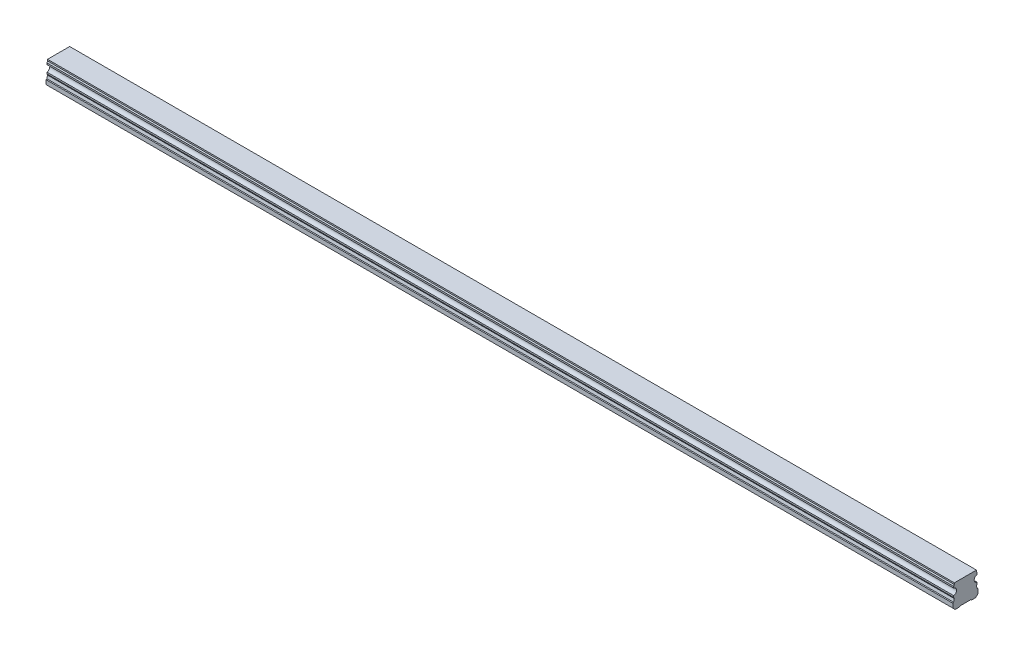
ISO-10303-21;
HEADER;
FILE_DESCRIPTION(('STEP AP214'),'2;1');
FILE_NAME('part.step','',(''),(''),'','','');
FILE_SCHEMA(('AUTOMOTIVE_DESIGN { 1 0 10303 214 1 1 1 1 }'));
ENDSEC;
DATA;
#1=APPLICATION_CONTEXT('core data for automotive mechanical design processes');
#2=APPLICATION_PROTOCOL_DEFINITION('international standard','automotive_design',2000,#1);
#3=PRODUCT_CONTEXT('',#1,'mechanical');
#4=PRODUCT('Part','Part','',(#3));
#5=PRODUCT_RELATED_PRODUCT_CATEGORY('part','',(#4));
#6=PRODUCT_DEFINITION_FORMATION('','',#4);
#7=PRODUCT_DEFINITION_CONTEXT('part definition',#1,'design');
#8=PRODUCT_DEFINITION('design','',#6,#7);
#9=PRODUCT_DEFINITION_SHAPE('','',#8);
#10=(LENGTH_UNIT() NAMED_UNIT(*) SI_UNIT(.MILLI.,.METRE.));
#11=(NAMED_UNIT(*) PLANE_ANGLE_UNIT() SI_UNIT($,.RADIAN.));
#12=(NAMED_UNIT(*) SI_UNIT($,.STERADIAN.) SOLID_ANGLE_UNIT());
#13=UNCERTAINTY_MEASURE_WITH_UNIT(LENGTH_MEASURE(1.E-05),#10,'distance_accuracy_value','');
#14=(GEOMETRIC_REPRESENTATION_CONTEXT(3) GLOBAL_UNCERTAINTY_ASSIGNED_CONTEXT((#13)) GLOBAL_UNIT_ASSIGNED_CONTEXT((#10,
#11,#12)) REPRESENTATION_CONTEXT('',''));
#15=CARTESIAN_POINT('',(0.,0.,0.));
#16=DIRECTION('',(0.,0.,1.));
#17=DIRECTION('',(1.,0.,0.));
#18=AXIS2_PLACEMENT_3D('',#15,#16,#17);
#19=CARTESIAN_POINT('',(510.,0.399999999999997,0.));
#20=DIRECTION('',(0.,-1.,0.));
#21=DIRECTION('',(0.,0.,-1.));
#22=AXIS2_PLACEMENT_3D('',#19,#20,#21);
#23=CONICAL_SURFACE('',#22,2.90000000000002,0.785398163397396);
#24=CARTESIAN_POINT('',(510.,0.800000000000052,0.));
#25=DIRECTION('',(0.,1.,0.));
#26=DIRECTION('',(0.,0.,1.));
#27=AXIS2_PLACEMENT_3D('',#24,#25,#26);
#28=CIRCLE('',#27,2.5);
#29=CARTESIAN_POINT('',(510.,0.800000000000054,2.5));
#30=VERTEX_POINT('',#29);
#31=EDGE_CURVE('E11',#30,#30,#28,.F.);
#32=ORIENTED_EDGE('',*,*,#31,.F.);
#33=EDGE_LOOP('',(#32));
#34=FACE_BOUND('',#33,.T.);
#35=CARTESIAN_POINT('',(510.,0.399999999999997,0.));
#36=DIRECTION('',(0.,1.,0.));
#37=DIRECTION('',(0.,0.,1.));
#38=AXIS2_PLACEMENT_3D('',#35,#36,#37);
#39=CIRCLE('',#38,2.90000000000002);
#40=CARTESIAN_POINT('',(510.,0.399999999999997,2.90000000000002));
#41=VERTEX_POINT('',#40);
#42=EDGE_CURVE('E505',#41,#41,#39,.T.);
#43=ORIENTED_EDGE('',*,*,#42,.F.);
#44=EDGE_LOOP('',(#43));
#45=FACE_BOUND('',#44,.T.);
#46=ADVANCED_FACE('F39',(#34,#45),#23,.F.);
#47=CARTESIAN_POINT('',(510.,7.,0.));
#48=DIRECTION('',(0.,-1.,0.));
#49=DIRECTION('',(0.,0.,-1.));
#50=AXIS2_PLACEMENT_3D('',#47,#48,#49);
#51=CYLINDRICAL_SURFACE('',#50,2.5);
#52=ORIENTED_EDGE('',*,*,#31,.T.);
#53=EDGE_LOOP('',(#52));
#54=FACE_BOUND('',#53,.T.);
#55=CARTESIAN_POINT('',(510.,7.,0.));
#56=DIRECTION('',(0.,-1.,0.));
#57=DIRECTION('',(0.,0.,-1.));
#58=AXIS2_PLACEMENT_3D('',#55,#56,#57);
#59=CIRCLE('',#58,2.5);
#60=CARTESIAN_POINT('',(510.,7.,-2.50000000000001));
#61=VERTEX_POINT('',#60);
#62=EDGE_CURVE('E49',#61,#61,#59,.T.);
#63=ORIENTED_EDGE('',*,*,#62,.F.);
#64=EDGE_LOOP('',(#63));
#65=FACE_BOUND('',#64,.T.);
#66=ADVANCED_FACE('F684',(#54,#65),#51,.F.);
#67=CARTESIAN_POINT('',(510.,7.,0.));
#68=DIRECTION('',(0.,-1.,0.));
#69=DIRECTION('',(0.,0.,-1.));
#70=AXIS2_PLACEMENT_3D('',#67,#68,#69);
#71=PLANE('',#70);
#72=CARTESIAN_POINT('',(510.,7.,0.));
#73=DIRECTION('',(0.,-1.,0.));
#74=DIRECTION('',(0.,0.,-1.));
#75=AXIS2_PLACEMENT_3D('',#72,#73,#74);
#76=CIRCLE('',#75,2.1);
#77=CARTESIAN_POINT('',(510.,7.,-2.1));
#78=VERTEX_POINT('',#77);
#79=EDGE_CURVE('E42',#78,#78,#76,.T.);
#80=ORIENTED_EDGE('',*,*,#79,.F.);
#81=EDGE_LOOP('',(#80));
#82=FACE_BOUND('',#81,.T.);
#83=ORIENTED_EDGE('',*,*,#62,.T.);
#84=EDGE_LOOP('',(#83));
#85=FACE_BOUND('',#84,.T.);
#86=ADVANCED_FACE('F689',(#82,#85),#71,.T.);
#87=CARTESIAN_POINT('',(450.,0.399999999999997,0.));
#88=DIRECTION('',(0.,-1.,0.));
#89=DIRECTION('',(0.,0.,-1.));
#90=AXIS2_PLACEMENT_3D('',#87,#88,#89);
#91=CONICAL_SURFACE('',#90,2.90000000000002,0.785398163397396);
#92=CARTESIAN_POINT('',(450.,0.800000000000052,0.));
#93=DIRECTION('',(0.,1.,0.));
#94=DIRECTION('',(0.,0.,1.));
#95=AXIS2_PLACEMENT_3D('',#92,#93,#94);
#96=CIRCLE('',#95,2.5);
#97=CARTESIAN_POINT('',(450.,0.800000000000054,2.5));
#98=VERTEX_POINT('',#97);
#99=EDGE_CURVE('E501',#98,#98,#96,.F.);
#100=ORIENTED_EDGE('',*,*,#99,.F.);
#101=EDGE_LOOP('',(#100));
#102=FACE_BOUND('',#101,.T.);
#103=CARTESIAN_POINT('',(450.,0.399999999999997,0.));
#104=DIRECTION('',(0.,1.,0.));
#105=DIRECTION('',(0.,0.,1.));
#106=AXIS2_PLACEMENT_3D('',#103,#104,#105);
#107=CIRCLE('',#106,2.90000000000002);
#108=CARTESIAN_POINT('',(450.,0.399999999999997,2.90000000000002));
#109=VERTEX_POINT('',#108);
#110=EDGE_CURVE('E493',#109,#109,#107,.T.);
#111=ORIENTED_EDGE('',*,*,#110,.F.);
#112=EDGE_LOOP('',(#111));
#113=FACE_BOUND('',#112,.T.);
#114=ADVANCED_FACE('F836',(#102,#113),#91,.F.);
#115=CARTESIAN_POINT('',(450.,7.,0.));
#116=DIRECTION('',(0.,-1.,0.));
#117=DIRECTION('',(0.,0.,-1.));
#118=AXIS2_PLACEMENT_3D('',#115,#116,#117);
#119=CYLINDRICAL_SURFACE('',#118,2.5);
#120=ORIENTED_EDGE('',*,*,#99,.T.);
#121=EDGE_LOOP('',(#120));
#122=FACE_BOUND('',#121,.T.);
#123=CARTESIAN_POINT('',(450.,7.,0.));
#124=DIRECTION('',(0.,-1.,0.));
#125=DIRECTION('',(0.,0.,-1.));
#126=AXIS2_PLACEMENT_3D('',#123,#124,#125);
#127=CIRCLE('',#126,2.5);
#128=CARTESIAN_POINT('',(450.,7.,-2.50000000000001));
#129=VERTEX_POINT('',#128);
#130=EDGE_CURVE('E497',#129,#129,#127,.T.);
#131=ORIENTED_EDGE('',*,*,#130,.F.);
#132=EDGE_LOOP('',(#131));
#133=FACE_BOUND('',#132,.T.);
#134=ADVANCED_FACE('F832',(#122,#133),#119,.F.);
#135=CARTESIAN_POINT('',(450.,7.,0.));
#136=DIRECTION('',(0.,-1.,0.));
#137=DIRECTION('',(0.,0.,-1.));
#138=AXIS2_PLACEMENT_3D('',#135,#136,#137);
#139=PLANE('',#138);
#140=CARTESIAN_POINT('',(450.,7.,0.));
#141=DIRECTION('',(0.,-1.,0.));
#142=DIRECTION('',(0.,0.,-1.));
#143=AXIS2_PLACEMENT_3D('',#140,#141,#142);
#144=CIRCLE('',#143,2.1);
#145=CARTESIAN_POINT('',(450.,7.,-2.1));
#146=VERTEX_POINT('',#145);
#147=EDGE_CURVE('E536',#146,#146,#144,.T.);
#148=ORIENTED_EDGE('',*,*,#147,.F.);
#149=EDGE_LOOP('',(#148));
#150=FACE_BOUND('',#149,.T.);
#151=ORIENTED_EDGE('',*,*,#130,.T.);
#152=EDGE_LOOP('',(#151));
#153=FACE_BOUND('',#152,.T.);
#154=ADVANCED_FACE('F828',(#150,#153),#139,.T.);
#155=CARTESIAN_POINT('',(390.,0.399999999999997,0.));
#156=DIRECTION('',(0.,-1.,0.));
#157=DIRECTION('',(0.,0.,-1.));
#158=AXIS2_PLACEMENT_3D('',#155,#156,#157);
#159=CONICAL_SURFACE('',#158,2.90000000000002,0.785398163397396);
#160=CARTESIAN_POINT('',(390.,0.800000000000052,0.));
#161=DIRECTION('',(0.,1.,0.));
#162=DIRECTION('',(0.,0.,1.));
#163=AXIS2_PLACEMENT_3D('',#160,#161,#162);
#164=CIRCLE('',#163,2.5);
#165=CARTESIAN_POINT('',(390.,0.800000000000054,2.5));
#166=VERTEX_POINT('',#165);
#167=EDGE_CURVE('E489',#166,#166,#164,.F.);
#168=ORIENTED_EDGE('',*,*,#167,.F.);
#169=EDGE_LOOP('',(#168));
#170=FACE_BOUND('',#169,.T.);
#171=CARTESIAN_POINT('',(390.,0.399999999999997,0.));
#172=DIRECTION('',(0.,1.,0.));
#173=DIRECTION('',(0.,0.,1.));
#174=AXIS2_PLACEMENT_3D('',#171,#172,#173);
#175=CIRCLE('',#174,2.90000000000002);
#176=CARTESIAN_POINT('',(390.,0.399999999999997,2.90000000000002));
#177=VERTEX_POINT('',#176);
#178=EDGE_CURVE('E481',#177,#177,#175,.T.);
#179=ORIENTED_EDGE('',*,*,#178,.F.);
#180=EDGE_LOOP('',(#179));
#181=FACE_BOUND('',#180,.T.);
#182=ADVANCED_FACE('F824',(#170,#181),#159,.F.);
#183=CARTESIAN_POINT('',(390.,7.,0.));
#184=DIRECTION('',(0.,-1.,0.));
#185=DIRECTION('',(0.,0.,-1.));
#186=AXIS2_PLACEMENT_3D('',#183,#184,#185);
#187=CYLINDRICAL_SURFACE('',#186,2.5);
#188=ORIENTED_EDGE('',*,*,#167,.T.);
#189=EDGE_LOOP('',(#188));
#190=FACE_BOUND('',#189,.T.);
#191=CARTESIAN_POINT('',(390.,7.,0.));
#192=DIRECTION('',(0.,-1.,0.));
#193=DIRECTION('',(0.,0.,-1.));
#194=AXIS2_PLACEMENT_3D('',#191,#192,#193);
#195=CIRCLE('',#194,2.5);
#196=CARTESIAN_POINT('',(390.,7.,-2.50000000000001));
#197=VERTEX_POINT('',#196);
#198=EDGE_CURVE('E485',#197,#197,#195,.T.);
#199=ORIENTED_EDGE('',*,*,#198,.F.);
#200=EDGE_LOOP('',(#199));
#201=FACE_BOUND('',#200,.T.);
#202=ADVANCED_FACE('F820',(#190,#201),#187,.F.);
#203=CARTESIAN_POINT('',(390.,7.,0.));
#204=DIRECTION('',(0.,-1.,0.));
#205=DIRECTION('',(0.,0.,-1.));
#206=AXIS2_PLACEMENT_3D('',#203,#204,#205);
#207=PLANE('',#206);
#208=CARTESIAN_POINT('',(390.,7.,0.));
#209=DIRECTION('',(0.,-1.,0.));
#210=DIRECTION('',(0.,0.,-1.));
#211=AXIS2_PLACEMENT_3D('',#208,#209,#210);
#212=CIRCLE('',#211,2.1);
#213=CARTESIAN_POINT('',(390.,7.,-2.1));
#214=VERTEX_POINT('',#213);
#215=EDGE_CURVE('E533',#214,#214,#212,.T.);
#216=ORIENTED_EDGE('',*,*,#215,.F.);
#217=EDGE_LOOP('',(#216));
#218=FACE_BOUND('',#217,.T.);
#219=ORIENTED_EDGE('',*,*,#198,.T.);
#220=EDGE_LOOP('',(#219));
#221=FACE_BOUND('',#220,.T.);
#222=ADVANCED_FACE('F816',(#218,#221),#207,.T.);
#223=CARTESIAN_POINT('',(330.,0.399999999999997,0.));
#224=DIRECTION('',(0.,-1.,0.));
#225=DIRECTION('',(0.,0.,-1.));
#226=AXIS2_PLACEMENT_3D('',#223,#224,#225);
#227=CONICAL_SURFACE('',#226,2.90000000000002,0.785398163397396);
#228=CARTESIAN_POINT('',(330.,0.800000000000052,0.));
#229=DIRECTION('',(0.,1.,0.));
#230=DIRECTION('',(0.,0.,1.));
#231=AXIS2_PLACEMENT_3D('',#228,#229,#230);
#232=CIRCLE('',#231,2.5);
#233=CARTESIAN_POINT('',(330.,0.800000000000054,2.5));
#234=VERTEX_POINT('',#233);
#235=EDGE_CURVE('E477',#234,#234,#232,.F.);
#236=ORIENTED_EDGE('',*,*,#235,.F.);
#237=EDGE_LOOP('',(#236));
#238=FACE_BOUND('',#237,.T.);
#239=CARTESIAN_POINT('',(330.,0.399999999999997,0.));
#240=DIRECTION('',(0.,1.,0.));
#241=DIRECTION('',(0.,0.,1.));
#242=AXIS2_PLACEMENT_3D('',#239,#240,#241);
#243=CIRCLE('',#242,2.90000000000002);
#244=CARTESIAN_POINT('',(330.,0.399999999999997,2.90000000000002));
#245=VERTEX_POINT('',#244);
#246=EDGE_CURVE('E470',#245,#245,#243,.T.);
#247=ORIENTED_EDGE('',*,*,#246,.F.);
#248=EDGE_LOOP('',(#247));
#249=FACE_BOUND('',#248,.T.);
#250=ADVANCED_FACE('F812',(#238,#249),#227,.F.);
#251=CARTESIAN_POINT('',(330.,7.,0.));
#252=DIRECTION('',(0.,-1.,0.));
#253=DIRECTION('',(0.,0.,-1.));
#254=AXIS2_PLACEMENT_3D('',#251,#252,#253);
#255=CYLINDRICAL_SURFACE('',#254,2.5);
#256=ORIENTED_EDGE('',*,*,#235,.T.);
#257=EDGE_LOOP('',(#256));
#258=FACE_BOUND('',#257,.T.);
#259=CARTESIAN_POINT('',(330.,7.,0.));
#260=DIRECTION('',(0.,-1.,0.));
#261=DIRECTION('',(0.,0.,-1.));
#262=AXIS2_PLACEMENT_3D('',#259,#260,#261);
#263=CIRCLE('',#262,2.5);
#264=CARTESIAN_POINT('',(330.,7.,-2.50000000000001));
#265=VERTEX_POINT('',#264);
#266=EDGE_CURVE('E474',#265,#265,#263,.T.);
#267=ORIENTED_EDGE('',*,*,#266,.F.);
#268=EDGE_LOOP('',(#267));
#269=FACE_BOUND('',#268,.T.);
#270=ADVANCED_FACE('F808',(#258,#269),#255,.F.);
#271=CARTESIAN_POINT('',(330.,7.,0.));
#272=DIRECTION('',(0.,-1.,0.));
#273=DIRECTION('',(0.,0.,-1.));
#274=AXIS2_PLACEMENT_3D('',#271,#272,#273);
#275=PLANE('',#274);
#276=CARTESIAN_POINT('',(330.,7.,0.));
#277=DIRECTION('',(0.,-1.,0.));
#278=DIRECTION('',(0.,0.,-1.));
#279=AXIS2_PLACEMENT_3D('',#276,#277,#278);
#280=CIRCLE('',#279,2.1);
#281=CARTESIAN_POINT('',(330.,7.,-2.1));
#282=VERTEX_POINT('',#281);
#283=EDGE_CURVE('E529',#282,#282,#280,.T.);
#284=ORIENTED_EDGE('',*,*,#283,.F.);
#285=EDGE_LOOP('',(#284));
#286=FACE_BOUND('',#285,.T.);
#287=ORIENTED_EDGE('',*,*,#266,.T.);
#288=EDGE_LOOP('',(#287));
#289=FACE_BOUND('',#288,.T.);
#290=ADVANCED_FACE('F804',(#286,#289),#275,.T.);
#291=CARTESIAN_POINT('',(270.,0.399999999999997,0.));
#292=DIRECTION('',(0.,-1.,0.));
#293=DIRECTION('',(0.,0.,-1.));
#294=AXIS2_PLACEMENT_3D('',#291,#292,#293);
#295=CONICAL_SURFACE('',#294,2.90000000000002,0.785398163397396);
#296=CARTESIAN_POINT('',(270.,0.800000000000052,0.));
#297=DIRECTION('',(0.,1.,0.));
#298=DIRECTION('',(0.,0.,1.));
#299=AXIS2_PLACEMENT_3D('',#296,#297,#298);
#300=CIRCLE('',#299,2.5);
#301=CARTESIAN_POINT('',(270.,0.800000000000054,2.5));
#302=VERTEX_POINT('',#301);
#303=EDGE_CURVE('E466',#302,#302,#300,.F.);
#304=ORIENTED_EDGE('',*,*,#303,.F.);
#305=EDGE_LOOP('',(#304));
#306=FACE_BOUND('',#305,.T.);
#307=CARTESIAN_POINT('',(270.,0.399999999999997,0.));
#308=DIRECTION('',(0.,1.,0.));
#309=DIRECTION('',(0.,0.,1.));
#310=AXIS2_PLACEMENT_3D('',#307,#308,#309);
#311=CIRCLE('',#310,2.90000000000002);
#312=CARTESIAN_POINT('',(270.,0.399999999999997,2.90000000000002));
#313=VERTEX_POINT('',#312);
#314=EDGE_CURVE('E458',#313,#313,#311,.T.);
#315=ORIENTED_EDGE('',*,*,#314,.F.);
#316=EDGE_LOOP('',(#315));
#317=FACE_BOUND('',#316,.T.);
#318=ADVANCED_FACE('F800',(#306,#317),#295,.F.);
#319=CARTESIAN_POINT('',(270.,7.,0.));
#320=DIRECTION('',(0.,-1.,0.));
#321=DIRECTION('',(0.,0.,-1.));
#322=AXIS2_PLACEMENT_3D('',#319,#320,#321);
#323=CYLINDRICAL_SURFACE('',#322,2.5);
#324=ORIENTED_EDGE('',*,*,#303,.T.);
#325=EDGE_LOOP('',(#324));
#326=FACE_BOUND('',#325,.T.);
#327=CARTESIAN_POINT('',(270.,7.,0.));
#328=DIRECTION('',(0.,-1.,0.));
#329=DIRECTION('',(0.,0.,-1.));
#330=AXIS2_PLACEMENT_3D('',#327,#328,#329);
#331=CIRCLE('',#330,2.5);
#332=CARTESIAN_POINT('',(270.,7.,-2.50000000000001));
#333=VERTEX_POINT('',#332);
#334=EDGE_CURVE('E462',#333,#333,#331,.T.);
#335=ORIENTED_EDGE('',*,*,#334,.F.);
#336=EDGE_LOOP('',(#335));
#337=FACE_BOUND('',#336,.T.);
#338=ADVANCED_FACE('F796',(#326,#337),#323,.F.);
#339=CARTESIAN_POINT('',(270.,7.,0.));
#340=DIRECTION('',(0.,-1.,0.));
#341=DIRECTION('',(0.,0.,-1.));
#342=AXIS2_PLACEMENT_3D('',#339,#340,#341);
#343=PLANE('',#342);
#344=CARTESIAN_POINT('',(270.,7.,0.));
#345=DIRECTION('',(0.,-1.,0.));
#346=DIRECTION('',(0.,0.,-1.));
#347=AXIS2_PLACEMENT_3D('',#344,#345,#346);
#348=CIRCLE('',#347,2.1);
#349=CARTESIAN_POINT('',(270.,7.,-2.1));
#350=VERTEX_POINT('',#349);
#351=EDGE_CURVE('E525',#350,#350,#348,.T.);
#352=ORIENTED_EDGE('',*,*,#351,.F.);
#353=EDGE_LOOP('',(#352));
#354=FACE_BOUND('',#353,.T.);
#355=ORIENTED_EDGE('',*,*,#334,.T.);
#356=EDGE_LOOP('',(#355));
#357=FACE_BOUND('',#356,.T.);
#358=ADVANCED_FACE('F792',(#354,#357),#343,.T.);
#359=CARTESIAN_POINT('',(210.,0.399999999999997,0.));
#360=DIRECTION('',(0.,-1.,0.));
#361=DIRECTION('',(0.,0.,-1.));
#362=AXIS2_PLACEMENT_3D('',#359,#360,#361);
#363=CONICAL_SURFACE('',#362,2.90000000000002,0.785398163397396);
#364=CARTESIAN_POINT('',(210.,0.800000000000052,0.));
#365=DIRECTION('',(0.,1.,0.));
#366=DIRECTION('',(0.,0.,1.));
#367=AXIS2_PLACEMENT_3D('',#364,#365,#366);
#368=CIRCLE('',#367,2.5);
#369=CARTESIAN_POINT('',(210.,0.800000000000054,2.5));
#370=VERTEX_POINT('',#369);
#371=EDGE_CURVE('E454',#370,#370,#368,.F.);
#372=ORIENTED_EDGE('',*,*,#371,.F.);
#373=EDGE_LOOP('',(#372));
#374=FACE_BOUND('',#373,.T.);
#375=CARTESIAN_POINT('',(210.,0.399999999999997,0.));
#376=DIRECTION('',(0.,1.,0.));
#377=DIRECTION('',(0.,0.,1.));
#378=AXIS2_PLACEMENT_3D('',#375,#376,#377);
#379=CIRCLE('',#378,2.90000000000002);
#380=CARTESIAN_POINT('',(210.,0.399999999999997,2.90000000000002));
#381=VERTEX_POINT('',#380);
#382=EDGE_CURVE('E446',#381,#381,#379,.T.);
#383=ORIENTED_EDGE('',*,*,#382,.F.);
#384=EDGE_LOOP('',(#383));
#385=FACE_BOUND('',#384,.T.);
#386=ADVANCED_FACE('F788',(#374,#385),#363,.F.);
#387=CARTESIAN_POINT('',(210.,7.,0.));
#388=DIRECTION('',(0.,-1.,0.));
#389=DIRECTION('',(0.,0.,-1.));
#390=AXIS2_PLACEMENT_3D('',#387,#388,#389);
#391=CYLINDRICAL_SURFACE('',#390,2.5);
#392=ORIENTED_EDGE('',*,*,#371,.T.);
#393=EDGE_LOOP('',(#392));
#394=FACE_BOUND('',#393,.T.);
#395=CARTESIAN_POINT('',(210.,7.,0.));
#396=DIRECTION('',(0.,-1.,0.));
#397=DIRECTION('',(0.,0.,-1.));
#398=AXIS2_PLACEMENT_3D('',#395,#396,#397);
#399=CIRCLE('',#398,2.5);
#400=CARTESIAN_POINT('',(210.,7.,-2.50000000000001));
#401=VERTEX_POINT('',#400);
#402=EDGE_CURVE('E450',#401,#401,#399,.T.);
#403=ORIENTED_EDGE('',*,*,#402,.F.);
#404=EDGE_LOOP('',(#403));
#405=FACE_BOUND('',#404,.T.);
#406=ADVANCED_FACE('F784',(#394,#405),#391,.F.);
#407=CARTESIAN_POINT('',(210.,7.,0.));
#408=DIRECTION('',(0.,-1.,0.));
#409=DIRECTION('',(0.,0.,-1.));
#410=AXIS2_PLACEMENT_3D('',#407,#408,#409);
#411=PLANE('',#410);
#412=CARTESIAN_POINT('',(210.,7.,0.));
#413=DIRECTION('',(0.,-1.,0.));
#414=DIRECTION('',(0.,0.,-1.));
#415=AXIS2_PLACEMENT_3D('',#412,#413,#414);
#416=CIRCLE('',#415,2.1);
#417=CARTESIAN_POINT('',(210.,7.,-2.1));
#418=VERTEX_POINT('',#417);
#419=EDGE_CURVE('E521',#418,#418,#416,.T.);
#420=ORIENTED_EDGE('',*,*,#419,.F.);
#421=EDGE_LOOP('',(#420));
#422=FACE_BOUND('',#421,.T.);
#423=ORIENTED_EDGE('',*,*,#402,.T.);
#424=EDGE_LOOP('',(#423));
#425=FACE_BOUND('',#424,.T.);
#426=ADVANCED_FACE('F780',(#422,#425),#411,.T.);
#427=CARTESIAN_POINT('',(150.,0.399999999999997,0.));
#428=DIRECTION('',(0.,-1.,0.));
#429=DIRECTION('',(0.,0.,-1.));
#430=AXIS2_PLACEMENT_3D('',#427,#428,#429);
#431=CONICAL_SURFACE('',#430,2.90000000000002,0.785398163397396);
#432=CARTESIAN_POINT('',(150.,0.800000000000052,0.));
#433=DIRECTION('',(0.,1.,0.));
#434=DIRECTION('',(0.,0.,1.));
#435=AXIS2_PLACEMENT_3D('',#432,#433,#434);
#436=CIRCLE('',#435,2.5);
#437=CARTESIAN_POINT('',(150.,0.800000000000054,2.5));
#438=VERTEX_POINT('',#437);
#439=EDGE_CURVE('E442',#438,#438,#436,.F.);
#440=ORIENTED_EDGE('',*,*,#439,.F.);
#441=EDGE_LOOP('',(#440));
#442=FACE_BOUND('',#441,.T.);
#443=CARTESIAN_POINT('',(150.,0.399999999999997,0.));
#444=DIRECTION('',(0.,1.,0.));
#445=DIRECTION('',(0.,0.,1.));
#446=AXIS2_PLACEMENT_3D('',#443,#444,#445);
#447=CIRCLE('',#446,2.90000000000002);
#448=CARTESIAN_POINT('',(150.,0.399999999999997,2.90000000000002));
#449=VERTEX_POINT('',#448);
#450=EDGE_CURVE('E434',#449,#449,#447,.T.);
#451=ORIENTED_EDGE('',*,*,#450,.F.);
#452=EDGE_LOOP('',(#451));
#453=FACE_BOUND('',#452,.T.);
#454=ADVANCED_FACE('F776',(#442,#453),#431,.F.);
#455=CARTESIAN_POINT('',(150.,7.,0.));
#456=DIRECTION('',(0.,-1.,0.));
#457=DIRECTION('',(0.,0.,-1.));
#458=AXIS2_PLACEMENT_3D('',#455,#456,#457);
#459=CYLINDRICAL_SURFACE('',#458,2.5);
#460=ORIENTED_EDGE('',*,*,#439,.T.);
#461=EDGE_LOOP('',(#460));
#462=FACE_BOUND('',#461,.T.);
#463=CARTESIAN_POINT('',(150.,7.,0.));
#464=DIRECTION('',(0.,-1.,0.));
#465=DIRECTION('',(0.,0.,-1.));
#466=AXIS2_PLACEMENT_3D('',#463,#464,#465);
#467=CIRCLE('',#466,2.5);
#468=CARTESIAN_POINT('',(150.,7.,-2.50000000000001));
#469=VERTEX_POINT('',#468);
#470=EDGE_CURVE('E438',#469,#469,#467,.T.);
#471=ORIENTED_EDGE('',*,*,#470,.F.);
#472=EDGE_LOOP('',(#471));
#473=FACE_BOUND('',#472,.T.);
#474=ADVANCED_FACE('F772',(#462,#473),#459,.F.);
#475=CARTESIAN_POINT('',(150.,7.,0.));
#476=DIRECTION('',(0.,-1.,0.));
#477=DIRECTION('',(0.,0.,-1.));
#478=AXIS2_PLACEMENT_3D('',#475,#476,#477);
#479=PLANE('',#478);
#480=CARTESIAN_POINT('',(150.,7.,0.));
#481=DIRECTION('',(0.,-1.,0.));
#482=DIRECTION('',(0.,0.,-1.));
#483=AXIS2_PLACEMENT_3D('',#480,#481,#482);
#484=CIRCLE('',#483,2.1);
#485=CARTESIAN_POINT('',(150.,7.,-2.1));
#486=VERTEX_POINT('',#485);
#487=EDGE_CURVE('E516',#486,#486,#484,.T.);
#488=ORIENTED_EDGE('',*,*,#487,.F.);
#489=EDGE_LOOP('',(#488));
#490=FACE_BOUND('',#489,.T.);
#491=ORIENTED_EDGE('',*,*,#470,.T.);
#492=EDGE_LOOP('',(#491));
#493=FACE_BOUND('',#492,.T.);
#494=ADVANCED_FACE('F762',(#490,#493),#479,.T.);
#495=CARTESIAN_POINT('',(540.,14.,-6.59000000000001));
#496=DIRECTION('',(0.,0.,1.));
#497=DIRECTION('',(0.,-1.,0.));
#498=AXIS2_PLACEMENT_3D('',#495,#496,#497);
#499=PLANE('',#498);
#500=DIRECTION('',(0.,1.,0.));
#501=VECTOR('',#500,1.);
#502=CARTESIAN_POINT('',(0.,14.,-6.59000000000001));
#503=LINE('',#502,#501);
#504=CARTESIAN_POINT('',(0.,13.15,-6.59));
#505=VERTEX_POINT('',#504);
#506=CARTESIAN_POINT('',(0.,14.,-6.59000000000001));
#507=VERTEX_POINT('',#506);
#508=EDGE_CURVE('E255',#505,#507,#503,.T.);
#509=ORIENTED_EDGE('',*,*,#508,.T.);
#510=DIRECTION('',(-1.,0.,0.));
#511=VECTOR('',#510,1.);
#512=CARTESIAN_POINT('',(540.,14.,-6.59000000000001));
#513=LINE('',#512,#511);
#514=CARTESIAN_POINT('',(540.,14.,-6.59000000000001));
#515=VERTEX_POINT('',#514);
#516=EDGE_CURVE('E423',#515,#507,#513,.T.);
#517=ORIENTED_EDGE('',*,*,#516,.F.);
#518=DIRECTION('',(0.,1.,0.));
#519=VECTOR('',#518,1.);
#520=CARTESIAN_POINT('',(540.,14.,-6.59000000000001));
#521=LINE('',#520,#519);
#522=CARTESIAN_POINT('',(540.,13.15,-6.59));
#523=VERTEX_POINT('',#522);
#524=EDGE_CURVE('E332',#523,#515,#521,.T.);
#525=ORIENTED_EDGE('',*,*,#524,.F.);
#526=DIRECTION('',(-1.,0.,0.));
#527=VECTOR('',#526,1.);
#528=CARTESIAN_POINT('',(540.,13.15,-6.59));
#529=LINE('',#528,#527);
#530=EDGE_CURVE('E251',#523,#505,#529,.T.);
#531=ORIENTED_EDGE('',*,*,#530,.T.);
#532=EDGE_LOOP('',(#509,#517,#525,#531));
#533=FACE_BOUND('',#532,.T.);
#534=ADVANCED_FACE('F759',(#533),#499,.F.);
#535=CARTESIAN_POINT('',(540.,14.,-6.59000000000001));
#536=DIRECTION('',(0.,-1.,0.));
#537=DIRECTION('',(0.,0.,-1.));
#538=AXIS2_PLACEMENT_3D('',#535,#536,#537);
#539=PLANE('',#538);
#540=DIRECTION('',(0.,0.,1.));
#541=VECTOR('',#540,1.);
#542=CARTESIAN_POINT('',(0.,14.,-6.59000000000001));
#543=LINE('',#542,#541);
#544=CARTESIAN_POINT('',(0.,14.,6.59));
#545=VERTEX_POINT('',#544);
#546=EDGE_CURVE('E259',#507,#545,#543,.T.);
#547=ORIENTED_EDGE('',*,*,#546,.T.);
#548=DIRECTION('',(-1.,0.,0.));
#549=VECTOR('',#548,1.);
#550=CARTESIAN_POINT('',(540.,14.,6.59));
#551=LINE('',#550,#549);
#552=CARTESIAN_POINT('',(540.,14.,6.59));
#553=VERTEX_POINT('',#552);
#554=EDGE_CURVE('E419',#553,#545,#551,.T.);
#555=ORIENTED_EDGE('',*,*,#554,.F.);
#556=DIRECTION('',(0.,0.,1.));
#557=VECTOR('',#556,1.);
#558=CARTESIAN_POINT('',(540.,14.,-6.59000000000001));
#559=LINE('',#558,#557);
#560=EDGE_CURVE('E157',#515,#553,#559,.T.);
#561=ORIENTED_EDGE('',*,*,#560,.F.);
#562=ORIENTED_EDGE('',*,*,#516,.T.);
#563=EDGE_LOOP('',(#547,#555,#561,#562));
#564=FACE_BOUND('',#563,.T.);
#565=ADVANCED_FACE('F755',(#564),#539,.F.);
#566=CARTESIAN_POINT('',(540.,14.,6.59));
#567=DIRECTION('',(0.,0.,-1.));
#568=DIRECTION('',(0.,1.,0.));
#569=AXIS2_PLACEMENT_3D('',#566,#567,#568);
#570=PLANE('',#569);
#571=DIRECTION('',(0.,-1.,0.));
#572=VECTOR('',#571,1.);
#573=CARTESIAN_POINT('',(0.,14.,6.59));
#574=LINE('',#573,#572);
#575=CARTESIAN_POINT('',(0.,13.15,6.59));
#576=VERTEX_POINT('',#575);
#577=EDGE_CURVE('E263',#545,#576,#574,.T.);
#578=ORIENTED_EDGE('',*,*,#577,.T.);
#579=DIRECTION('',(-1.,0.,0.));
#580=VECTOR('',#579,1.);
#581=CARTESIAN_POINT('',(540.,13.15,6.59));
#582=LINE('',#581,#580);
#583=CARTESIAN_POINT('',(540.,13.15,6.59));
#584=VERTEX_POINT('',#583);
#585=EDGE_CURVE('E415',#584,#576,#582,.T.);
#586=ORIENTED_EDGE('',*,*,#585,.F.);
#587=DIRECTION('',(0.,-1.,0.));
#588=VECTOR('',#587,1.);
#589=CARTESIAN_POINT('',(540.,14.,6.59));
#590=LINE('',#589,#588);
#591=EDGE_CURVE('E579',#553,#584,#590,.T.);
#592=ORIENTED_EDGE('',*,*,#591,.F.);
#593=ORIENTED_EDGE('',*,*,#554,.T.);
#594=EDGE_LOOP('',(#578,#586,#592,#593));
#595=FACE_BOUND('',#594,.T.);
#596=ADVANCED_FACE('F751',(#595),#570,.F.);
#597=CARTESIAN_POINT('',(540.,13.15,6.59));
#598=DIRECTION('',(0.,-0.422618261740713,-0.906307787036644));
#599=DIRECTION('',(0.,0.906307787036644,-0.422618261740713));
#600=AXIS2_PLACEMENT_3D('',#597,#598,#599);
#601=PLANE('',#600);
#602=DIRECTION('',(0.,-0.906307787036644,0.422618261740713));
#603=VECTOR('',#602,1.);
#604=CARTESIAN_POINT('',(0.,13.15,6.59));
#605=LINE('',#604,#603);
#606=CARTESIAN_POINT('',(0.,12.3565324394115,6.96));
#607=VERTEX_POINT('',#606);
#608=EDGE_CURVE('E266',#576,#607,#605,.T.);
#609=ORIENTED_EDGE('',*,*,#608,.T.);
#610=DIRECTION('',(-1.,0.,0.));
#611=VECTOR('',#610,1.);
#612=CARTESIAN_POINT('',(540.,12.3565324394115,6.96));
#613=LINE('',#612,#611);
#614=CARTESIAN_POINT('',(540.,12.3565324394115,6.96));
#615=VERTEX_POINT('',#614);
#616=EDGE_CURVE('E411',#615,#607,#613,.T.);
#617=ORIENTED_EDGE('',*,*,#616,.F.);
#618=DIRECTION('',(0.,-0.906307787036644,0.422618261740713));
#619=VECTOR('',#618,1.);
#620=CARTESIAN_POINT('',(540.,13.15,6.59));
#621=LINE('',#620,#619);
#622=EDGE_CURVE('E582',#584,#615,#621,.T.);
#623=ORIENTED_EDGE('',*,*,#622,.F.);
#624=ORIENTED_EDGE('',*,*,#585,.T.);
#625=EDGE_LOOP('',(#609,#617,#623,#624));
#626=FACE_BOUND('',#625,.T.);
#627=ADVANCED_FACE('F747',(#626),#601,.F.);
#628=CARTESIAN_POINT('',(540.,12.3565324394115,6.96));
#629=DIRECTION('',(0.,0.,-1.));
#630=DIRECTION('',(0.,1.,0.));
#631=AXIS2_PLACEMENT_3D('',#628,#629,#630);
#632=PLANE('',#631);
#633=DIRECTION('',(0.,-1.,0.));
#634=VECTOR('',#633,1.);
#635=CARTESIAN_POINT('',(0.,12.3565324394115,6.96));
#636=LINE('',#635,#634);
#637=CARTESIAN_POINT('',(0.,11.4351744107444,6.96));
#638=VERTEX_POINT('',#637);
#639=EDGE_CURVE('E269',#607,#638,#636,.T.);
#640=ORIENTED_EDGE('',*,*,#639,.T.);
#641=DIRECTION('',(-1.,0.,0.));
#642=VECTOR('',#641,1.);
#643=CARTESIAN_POINT('',(540.,11.4351744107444,6.96));
#644=LINE('',#643,#642);
#645=CARTESIAN_POINT('',(540.,11.4351744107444,6.96));
#646=VERTEX_POINT('',#645);
#647=EDGE_CURVE('E407',#646,#638,#644,.T.);
#648=ORIENTED_EDGE('',*,*,#647,.F.);
#649=DIRECTION('',(0.,-1.,0.));
#650=VECTOR('',#649,1.);
#651=CARTESIAN_POINT('',(540.,12.3565324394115,6.96));
#652=LINE('',#651,#650);
#653=EDGE_CURVE('E585',#615,#646,#652,.T.);
#654=ORIENTED_EDGE('',*,*,#653,.F.);
#655=ORIENTED_EDGE('',*,*,#616,.T.);
#656=EDGE_LOOP('',(#640,#648,#654,#655));
#657=FACE_BOUND('',#656,.T.);
#658=ADVANCED_FACE('F743',(#657),#632,.F.);
#659=CARTESIAN_POINT('',(540.,9.5,7.2));
#660=DIRECTION('',(-1.,0.,0.));
#661=DIRECTION('',(0.,0.,1.));
#662=AXIS2_PLACEMENT_3D('',#659,#660,#661);
#663=CYLINDRICAL_SURFACE('',#662,1.95);
#664=CARTESIAN_POINT('',(0.,9.5,7.2));
#665=DIRECTION('',(-1.,0.,0.));
#666=DIRECTION('',(0.,0.,-1.));
#667=AXIS2_PLACEMENT_3D('',#664,#665,#666);
#668=CIRCLE('',#667,1.95);
#669=CARTESIAN_POINT('',(0.,7.56482558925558,6.96));
#670=VERTEX_POINT('',#669);
#671=EDGE_CURVE('E272',#638,#670,#668,.T.);
#672=ORIENTED_EDGE('',*,*,#671,.T.);
#673=DIRECTION('',(-1.,0.,0.));
#674=VECTOR('',#673,1.);
#675=CARTESIAN_POINT('',(540.,7.56482558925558,6.96));
#676=LINE('',#675,#674);
#677=CARTESIAN_POINT('',(540.,7.56482558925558,6.96));
#678=VERTEX_POINT('',#677);
#679=EDGE_CURVE('E403',#678,#670,#676,.T.);
#680=ORIENTED_EDGE('',*,*,#679,.F.);
#681=CARTESIAN_POINT('',(540.,9.5,7.2));
#682=DIRECTION('',(-1.,0.,0.));
#683=DIRECTION('',(0.,0.,-1.));
#684=AXIS2_PLACEMENT_3D('',#681,#682,#683);
#685=CIRCLE('',#684,1.95);
#686=EDGE_CURVE('E588',#646,#678,#685,.T.);
#687=ORIENTED_EDGE('',*,*,#686,.F.);
#688=ORIENTED_EDGE('',*,*,#647,.T.);
#689=EDGE_LOOP('',(#672,#680,#687,#688));
#690=FACE_BOUND('',#689,.T.);
#691=ADVANCED_FACE('F739',(#690),#663,.F.);
#692=CARTESIAN_POINT('',(540.,7.56482558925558,6.96));
#693=DIRECTION('',(0.,0.,-1.));
#694=DIRECTION('',(0.,1.,0.));
#695=AXIS2_PLACEMENT_3D('',#692,#693,#694);
#696=PLANE('',#695);
#697=DIRECTION('',(0.,-1.,0.));
#698=VECTOR('',#697,1.);
#699=CARTESIAN_POINT('',(0.,7.56482558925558,6.96));
#700=LINE('',#699,#698);
#701=CARTESIAN_POINT('',(0.,6.64346756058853,6.96));
#702=VERTEX_POINT('',#701);
#703=EDGE_CURVE('E275',#670,#702,#700,.T.);
#704=ORIENTED_EDGE('',*,*,#703,.T.);
#705=DIRECTION('',(-1.,0.,0.));
#706=VECTOR('',#705,1.);
#707=CARTESIAN_POINT('',(540.,6.64346756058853,6.96));
#708=LINE('',#707,#706);
#709=CARTESIAN_POINT('',(540.,6.64346756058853,6.96));
#710=VERTEX_POINT('',#709);
#711=EDGE_CURVE('E399',#710,#702,#708,.T.);
#712=ORIENTED_EDGE('',*,*,#711,.F.);
#713=DIRECTION('',(0.,-1.,0.));
#714=VECTOR('',#713,1.);
#715=CARTESIAN_POINT('',(540.,7.56482558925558,6.96));
#716=LINE('',#715,#714);
#717=EDGE_CURVE('E591',#678,#710,#716,.T.);
#718=ORIENTED_EDGE('',*,*,#717,.F.);
#719=ORIENTED_EDGE('',*,*,#679,.T.);
#720=EDGE_LOOP('',(#704,#712,#718,#719));
#721=FACE_BOUND('',#720,.T.);
#722=ADVANCED_FACE('F735',(#721),#696,.F.);
#723=CARTESIAN_POINT('',(540.,6.64346756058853,6.96));
#724=DIRECTION('',(0.,0.422618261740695,-0.906307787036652));
#725=DIRECTION('',(0.,0.906307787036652,0.422618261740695));
#726=AXIS2_PLACEMENT_3D('',#723,#724,#725);
#727=PLANE('',#726);
#728=DIRECTION('',(0.,-0.906307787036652,-0.422618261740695));
#729=VECTOR('',#728,1.);
#730=CARTESIAN_POINT('',(0.,6.64346756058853,6.96));
#731=LINE('',#730,#729);
#732=CARTESIAN_POINT('',(0.,5.85,6.59000000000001));
#733=VERTEX_POINT('',#732);
#734=EDGE_CURVE('E278',#702,#733,#731,.T.);
#735=ORIENTED_EDGE('',*,*,#734,.T.);
#736=DIRECTION('',(-1.,0.,0.));
#737=VECTOR('',#736,1.);
#738=CARTESIAN_POINT('',(540.,5.85,6.59000000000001));
#739=LINE('',#738,#737);
#740=CARTESIAN_POINT('',(540.,5.85,6.59000000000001));
#741=VERTEX_POINT('',#740);
#742=EDGE_CURVE('E395',#741,#733,#739,.T.);
#743=ORIENTED_EDGE('',*,*,#742,.F.);
#744=DIRECTION('',(0.,-0.906307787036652,-0.422618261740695));
#745=VECTOR('',#744,1.);
#746=CARTESIAN_POINT('',(540.,6.64346756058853,6.96));
#747=LINE('',#746,#745);
#748=EDGE_CURVE('E594',#710,#741,#747,.T.);
#749=ORIENTED_EDGE('',*,*,#748,.F.);
#750=ORIENTED_EDGE('',*,*,#711,.T.);
#751=EDGE_LOOP('',(#735,#743,#749,#750));
#752=FACE_BOUND('',#751,.T.);
#753=ADVANCED_FACE('F731',(#752),#727,.F.);
#754=CARTESIAN_POINT('',(540.,5.85,6.59000000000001));
#755=DIRECTION('',(0.,-0.25881904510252,-0.965925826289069));
#756=DIRECTION('',(0.,0.965925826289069,-0.25881904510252));
#757=AXIS2_PLACEMENT_3D('',#754,#755,#756);
#758=PLANE('',#757);
#759=DIRECTION('',(0.,-0.965925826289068,0.25881904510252));
#760=VECTOR('',#759,1.);
#761=CARTESIAN_POINT('',(0.,5.85,6.59000000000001));
#762=LINE('',#761,#760);
#763=CARTESIAN_POINT('',(0.,4.2,7.03211616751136));
#764=VERTEX_POINT('',#763);
#765=EDGE_CURVE('E281',#733,#764,#762,.T.);
#766=ORIENTED_EDGE('',*,*,#765,.T.);
#767=DIRECTION('',(-1.,0.,0.));
#768=VECTOR('',#767,1.);
#769=CARTESIAN_POINT('',(540.,4.2,7.03211616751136));
#770=LINE('',#769,#768);
#771=CARTESIAN_POINT('',(540.,4.2,7.03211616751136));
#772=VERTEX_POINT('',#771);
#773=EDGE_CURVE('E391',#772,#764,#770,.T.);
#774=ORIENTED_EDGE('',*,*,#773,.F.);
#775=DIRECTION('',(0.,-0.965925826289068,0.25881904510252));
#776=VECTOR('',#775,1.);
#777=CARTESIAN_POINT('',(540.,5.85,6.59000000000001));
#778=LINE('',#777,#776);
#779=EDGE_CURVE('E597',#741,#772,#778,.T.);
#780=ORIENTED_EDGE('',*,*,#779,.F.);
#781=ORIENTED_EDGE('',*,*,#742,.T.);
#782=EDGE_LOOP('',(#766,#774,#780,#781));
#783=FACE_BOUND('',#782,.T.);
#784=ADVANCED_FACE('F727',(#783),#758,.F.);
#785=CARTESIAN_POINT('',(540.,4.2,7.03211616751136));
#786=DIRECTION('',(0.,-0.866025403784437,-0.500000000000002));
#787=DIRECTION('',(0.,0.500000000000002,-0.866025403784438));
#788=AXIS2_PLACEMENT_3D('',#785,#786,#787);
#789=PLANE('',#788);
#790=DIRECTION('',(0.,-0.500000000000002,0.866025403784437));
#791=VECTOR('',#790,1.);
#792=CARTESIAN_POINT('',(0.,4.2,7.03211616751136));
#793=LINE('',#792,#791);
#794=CARTESIAN_POINT('',(0.,3.92986714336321,7.5));
#795=VERTEX_POINT('',#794);
#796=EDGE_CURVE('E284',#764,#795,#793,.T.);
#797=ORIENTED_EDGE('',*,*,#796,.T.);
#798=DIRECTION('',(-1.,0.,0.));
#799=VECTOR('',#798,1.);
#800=CARTESIAN_POINT('',(540.,3.92986714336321,7.5));
#801=LINE('',#800,#799);
#802=CARTESIAN_POINT('',(540.,3.92986714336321,7.5));
#803=VERTEX_POINT('',#802);
#804=EDGE_CURVE('E387',#803,#795,#801,.T.);
#805=ORIENTED_EDGE('',*,*,#804,.F.);
#806=DIRECTION('',(0.,-0.500000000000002,0.866025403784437));
#807=VECTOR('',#806,1.);
#808=CARTESIAN_POINT('',(540.,4.2,7.03211616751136));
#809=LINE('',#808,#807);
#810=EDGE_CURVE('E600',#772,#803,#809,.T.);
#811=ORIENTED_EDGE('',*,*,#810,.F.);
#812=ORIENTED_EDGE('',*,*,#773,.T.);
#813=EDGE_LOOP('',(#797,#805,#811,#812));
#814=FACE_BOUND('',#813,.T.);
#815=ADVANCED_FACE('F723',(#814),#789,.F.);
#816=CARTESIAN_POINT('',(540.,3.92986714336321,7.5));
#817=DIRECTION('',(0.,0.,-1.));
#818=DIRECTION('',(0.,1.,0.));
#819=AXIS2_PLACEMENT_3D('',#816,#817,#818);
#820=PLANE('',#819);
#821=DIRECTION('',(0.,-1.,0.));
#822=VECTOR('',#821,1.);
#823=CARTESIAN_POINT('',(0.,3.92986714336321,7.5));
#824=LINE('',#823,#822);
#825=CARTESIAN_POINT('',(0.,1.4,7.5));
#826=VERTEX_POINT('',#825);
#827=EDGE_CURVE('E287',#795,#826,#824,.T.);
#828=ORIENTED_EDGE('',*,*,#827,.T.);
#829=DIRECTION('',(-1.,0.,0.));
#830=VECTOR('',#829,1.);
#831=CARTESIAN_POINT('',(540.,1.4,7.5));
#832=LINE('',#831,#830);
#833=CARTESIAN_POINT('',(540.,1.4,7.5));
#834=VERTEX_POINT('',#833);
#835=EDGE_CURVE('E383',#834,#826,#832,.T.);
#836=ORIENTED_EDGE('',*,*,#835,.F.);
#837=DIRECTION('',(0.,-1.,0.));
#838=VECTOR('',#837,1.);
#839=CARTESIAN_POINT('',(540.,3.92986714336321,7.5));
#840=LINE('',#839,#838);
#841=EDGE_CURVE('E603',#803,#834,#840,.T.);
#842=ORIENTED_EDGE('',*,*,#841,.F.);
#843=ORIENTED_EDGE('',*,*,#804,.T.);
#844=EDGE_LOOP('',(#828,#836,#842,#843));
#845=FACE_BOUND('',#844,.T.);
#846=ADVANCED_FACE('F719',(#845),#820,.F.);
#847=CARTESIAN_POINT('',(540.,1.4,7.5));
#848=DIRECTION('',(0.,0.70710678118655,-0.707106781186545));
#849=DIRECTION('',(0.,0.707106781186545,0.70710678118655));
#850=AXIS2_PLACEMENT_3D('',#847,#848,#849);
#851=PLANE('',#850);
#852=DIRECTION('',(0.,-0.707106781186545,-0.70710678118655));
#853=VECTOR('',#852,1.);
#854=CARTESIAN_POINT('',(0.,1.4,7.5));
#855=LINE('',#854,#853);
#856=CARTESIAN_POINT('',(0.,0.,6.1));
#857=VERTEX_POINT('',#856);
#858=EDGE_CURVE('E290',#826,#857,#855,.T.);
#859=ORIENTED_EDGE('',*,*,#858,.T.);
#860=DIRECTION('',(-1.,0.,0.));
#861=VECTOR('',#860,1.);
#862=CARTESIAN_POINT('',(540.,0.,6.1));
#863=LINE('',#862,#861);
#864=CARTESIAN_POINT('',(540.,0.,6.1));
#865=VERTEX_POINT('',#864);
#866=EDGE_CURVE('E379',#865,#857,#863,.T.);
#867=ORIENTED_EDGE('',*,*,#866,.F.);
#868=DIRECTION('',(0.,-0.707106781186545,-0.70710678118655));
#869=VECTOR('',#868,1.);
#870=CARTESIAN_POINT('',(540.,1.4,7.5));
#871=LINE('',#870,#869);
#872=EDGE_CURVE('E605',#834,#865,#871,.T.);
#873=ORIENTED_EDGE('',*,*,#872,.F.);
#874=ORIENTED_EDGE('',*,*,#835,.T.);
#875=EDGE_LOOP('',(#859,#867,#873,#874));
#876=FACE_BOUND('',#875,.T.);
#877=ADVANCED_FACE('F715',(#876),#851,.F.);
#878=CARTESIAN_POINT('',(540.,0.,6.1));
#879=DIRECTION('',(0.,1.,0.));
#880=DIRECTION('',(0.,0.,1.));
#881=AXIS2_PLACEMENT_3D('',#878,#879,#880);
#882=PLANE('',#881);
#883=DIRECTION('',(0.,0.,-1.));
#884=VECTOR('',#883,1.);
#885=CARTESIAN_POINT('',(0.,0.,6.1));
#886=LINE('',#885,#884);
#887=CARTESIAN_POINT('',(0.,0.,3.65));
#888=VERTEX_POINT('',#887);
#889=EDGE_CURVE('E293',#857,#888,#886,.T.);
#890=ORIENTED_EDGE('',*,*,#889,.T.);
#891=DIRECTION('',(-1.,0.,0.));
#892=VECTOR('',#891,1.);
#893=CARTESIAN_POINT('',(540.,0.,3.65));
#894=LINE('',#893,#892);
#895=CARTESIAN_POINT('',(540.,0.,3.65));
#896=VERTEX_POINT('',#895);
#897=EDGE_CURVE('E375',#896,#888,#894,.T.);
#898=ORIENTED_EDGE('',*,*,#897,.F.);
#899=DIRECTION('',(0.,0.,-1.));
#900=VECTOR('',#899,1.);
#901=CARTESIAN_POINT('',(540.,0.,6.1));
#902=LINE('',#901,#900);
#903=EDGE_CURVE('E608',#865,#896,#902,.T.);
#904=ORIENTED_EDGE('',*,*,#903,.F.);
#905=ORIENTED_EDGE('',*,*,#866,.T.);
#906=EDGE_LOOP('',(#890,#898,#904,#905));
#907=FACE_BOUND('',#906,.T.);
#908=ADVANCED_FACE('F707',(#907),#882,.F.);
#909=CARTESIAN_POINT('',(540.,0.,3.65));
#910=DIRECTION('',(0.,0.707106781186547,0.707106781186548));
#911=DIRECTION('',(0.,-0.707106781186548,0.707106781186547));
#912=AXIS2_PLACEMENT_3D('',#909,#910,#911);
#913=PLANE('',#912);
#914=DIRECTION('',(0.,0.707106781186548,-0.707106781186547));
#915=VECTOR('',#914,1.);
#916=CARTESIAN_POINT('',(0.,0.,3.65));
#917=LINE('',#916,#915);
#918=CARTESIAN_POINT('',(0.,0.399999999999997,3.25));
#919=VERTEX_POINT('',#918);
#920=EDGE_CURVE('E296',#888,#919,#917,.T.);
#921=ORIENTED_EDGE('',*,*,#920,.T.);
#922=DIRECTION('',(-1.,0.,0.));
#923=VECTOR('',#922,1.);
#924=CARTESIAN_POINT('',(540.,0.399999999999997,3.25));
#925=LINE('',#924,#923);
#926=CARTESIAN_POINT('',(540.,0.399999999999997,3.25));
#927=VERTEX_POINT('',#926);
#928=EDGE_CURVE('E371',#927,#919,#925,.T.);
#929=ORIENTED_EDGE('',*,*,#928,.F.);
#930=DIRECTION('',(0.,0.707106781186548,-0.707106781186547));
#931=VECTOR('',#930,1.);
#932=CARTESIAN_POINT('',(540.,0.,3.65));
#933=LINE('',#932,#931);
#934=EDGE_CURVE('E611',#896,#927,#933,.T.);
#935=ORIENTED_EDGE('',*,*,#934,.F.);
#936=ORIENTED_EDGE('',*,*,#897,.T.);
#937=EDGE_LOOP('',(#921,#929,#935,#936));
#938=FACE_BOUND('',#937,.T.);
#939=ADVANCED_FACE('F698',(#938),#913,.F.);
#940=CARTESIAN_POINT('',(540.,0.399999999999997,3.25));
#941=DIRECTION('',(0.,1.,0.));
#942=DIRECTION('',(0.,0.,1.));
#943=AXIS2_PLACEMENT_3D('',#940,#941,#942);
#944=PLANE('',#943);
#945=CARTESIAN_POINT('',(90.,0.399999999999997,0.));
#946=DIRECTION('',(0.,1.,0.));
#947=DIRECTION('',(0.,0.,1.));
#948=AXIS2_PLACEMENT_3D('',#945,#946,#947);
#949=CIRCLE('',#948,2.90000000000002);
#950=CARTESIAN_POINT('',(90.,0.399999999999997,2.90000000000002));
#951=VERTEX_POINT('',#950);
#952=EDGE_CURVE('E544',#951,#951,#949,.T.);
#953=ORIENTED_EDGE('',*,*,#952,.T.);
#954=EDGE_LOOP('',(#953));
#955=FACE_BOUND('',#954,.T.);
#956=CARTESIAN_POINT('',(30.,0.399999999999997,0.));
#957=DIRECTION('',(0.,1.,0.));
#958=DIRECTION('',(0.,0.,1.));
#959=AXIS2_PLACEMENT_3D('',#956,#957,#958);
#960=CIRCLE('',#959,2.90000000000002);
#961=CARTESIAN_POINT('',(30.,0.399999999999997,2.90000000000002));
#962=VERTEX_POINT('',#961);
#963=EDGE_CURVE('E426',#962,#962,#960,.T.);
#964=ORIENTED_EDGE('',*,*,#963,.T.);
#965=EDGE_LOOP('',(#964));
#966=FACE_BOUND('',#965,.T.);
#967=DIRECTION('',(0.,0.,-1.));
#968=VECTOR('',#967,1.);
#969=CARTESIAN_POINT('',(0.,0.399999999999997,3.25));
#970=LINE('',#969,#968);
#971=CARTESIAN_POINT('',(0.,0.399999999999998,-3.25));
#972=VERTEX_POINT('',#971);
#973=EDGE_CURVE('E299',#919,#972,#970,.T.);
#974=ORIENTED_EDGE('',*,*,#973,.T.);
#975=DIRECTION('',(-1.,0.,0.));
#976=VECTOR('',#975,1.);
#977=CARTESIAN_POINT('',(540.,0.399999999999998,-3.25));
#978=LINE('',#977,#976);
#979=CARTESIAN_POINT('',(540.,0.399999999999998,-3.25));
#980=VERTEX_POINT('',#979);
#981=EDGE_CURVE('E367',#980,#972,#978,.T.);
#982=ORIENTED_EDGE('',*,*,#981,.F.);
#983=DIRECTION('',(0.,0.,-1.));
#984=VECTOR('',#983,1.);
#985=CARTESIAN_POINT('',(540.,0.399999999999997,3.25));
#986=LINE('',#985,#984);
#987=EDGE_CURVE('E614',#927,#980,#986,.T.);
#988=ORIENTED_EDGE('',*,*,#987,.F.);
#989=ORIENTED_EDGE('',*,*,#928,.T.);
#990=EDGE_LOOP('',(#974,#982,#988,#989));
#991=FACE_BOUND('',#990,.T.);
#992=ORIENTED_EDGE('',*,*,#450,.T.);
#993=EDGE_LOOP('',(#992));
#994=FACE_BOUND('',#993,.T.);
#995=ORIENTED_EDGE('',*,*,#382,.T.);
#996=EDGE_LOOP('',(#995));
#997=FACE_BOUND('',#996,.T.);
#998=ORIENTED_EDGE('',*,*,#314,.T.);
#999=EDGE_LOOP('',(#998));
#1000=FACE_BOUND('',#999,.T.);
#1001=ORIENTED_EDGE('',*,*,#246,.T.);
#1002=EDGE_LOOP('',(#1001));
#1003=FACE_BOUND('',#1002,.T.);
#1004=ORIENTED_EDGE('',*,*,#178,.T.);
#1005=EDGE_LOOP('',(#1004));
#1006=FACE_BOUND('',#1005,.T.);
#1007=ORIENTED_EDGE('',*,*,#110,.T.);
#1008=EDGE_LOOP('',(#1007));
#1009=FACE_BOUND('',#1008,.T.);
#1010=ORIENTED_EDGE('',*,*,#42,.T.);
#1011=EDGE_LOOP('',(#1010));
#1012=FACE_BOUND('',#1011,.T.);
#1013=ADVANCED_FACE('F695',(#955,#966,#991,#994,#997,#1000,#1003,#1006,#1009,#1012),#944,.F.);
#1014=CARTESIAN_POINT('',(540.,0.399999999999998,-3.25));
#1015=DIRECTION('',(0.,0.707106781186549,-0.707106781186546));
#1016=DIRECTION('',(0.,0.707106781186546,0.707106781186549));
#1017=AXIS2_PLACEMENT_3D('',#1014,#1015,#1016);
#1018=PLANE('',#1017);
#1019=DIRECTION('',(0.,-0.707106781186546,-0.707106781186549));
#1020=VECTOR('',#1019,1.);
#1021=CARTESIAN_POINT('',(0.,0.399999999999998,-3.25));
#1022=LINE('',#1021,#1020);
#1023=CARTESIAN_POINT('',(0.,0.,-3.65));
#1024=VERTEX_POINT('',#1023);
#1025=EDGE_CURVE('E302',#972,#1024,#1022,.T.);
#1026=ORIENTED_EDGE('',*,*,#1025,.T.);
#1027=DIRECTION('',(-1.,0.,0.));
#1028=VECTOR('',#1027,1.);
#1029=CARTESIAN_POINT('',(540.,0.,-3.65));
#1030=LINE('',#1029,#1028);
#1031=CARTESIAN_POINT('',(540.,0.,-3.65));
#1032=VERTEX_POINT('',#1031);
#1033=EDGE_CURVE('E363',#1032,#1024,#1030,.T.);
#1034=ORIENTED_EDGE('',*,*,#1033,.F.);
#1035=DIRECTION('',(0.,-0.707106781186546,-0.707106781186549));
#1036=VECTOR('',#1035,1.);
#1037=CARTESIAN_POINT('',(540.,0.399999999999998,-3.25));
#1038=LINE('',#1037,#1036);
#1039=EDGE_CURVE('E617',#980,#1032,#1038,.T.);
#1040=ORIENTED_EDGE('',*,*,#1039,.F.);
#1041=ORIENTED_EDGE('',*,*,#981,.T.);
#1042=EDGE_LOOP('',(#1026,#1034,#1040,#1041));
#1043=FACE_BOUND('',#1042,.T.);
#1044=ADVANCED_FACE('F697',(#1043),#1018,.F.);
#1045=CARTESIAN_POINT('',(540.,0.,-3.65));
#1046=DIRECTION('',(0.,1.,0.));
#1047=DIRECTION('',(0.,0.,1.));
#1048=AXIS2_PLACEMENT_3D('',#1045,#1046,#1047);
#1049=PLANE('',#1048);
#1050=DIRECTION('',(0.,0.,-1.));
#1051=VECTOR('',#1050,1.);
#1052=CARTESIAN_POINT('',(0.,0.,-3.65));
#1053=LINE('',#1052,#1051);
#1054=CARTESIAN_POINT('',(0.,0.,-6.1));
#1055=VERTEX_POINT('',#1054);
#1056=EDGE_CURVE('E305',#1024,#1055,#1053,.T.);
#1057=ORIENTED_EDGE('',*,*,#1056,.T.);
#1058=DIRECTION('',(-1.,0.,0.));
#1059=VECTOR('',#1058,1.);
#1060=CARTESIAN_POINT('',(540.,0.,-6.1));
#1061=LINE('',#1060,#1059);
#1062=CARTESIAN_POINT('',(540.,0.,-6.1));
#1063=VERTEX_POINT('',#1062);
#1064=EDGE_CURVE('E359',#1063,#1055,#1061,.T.);
#1065=ORIENTED_EDGE('',*,*,#1064,.F.);
#1066=DIRECTION('',(0.,0.,-1.));
#1067=VECTOR('',#1066,1.);
#1068=CARTESIAN_POINT('',(540.,0.,-3.65));
#1069=LINE('',#1068,#1067);
#1070=EDGE_CURVE('E620',#1032,#1063,#1069,.T.);
#1071=ORIENTED_EDGE('',*,*,#1070,.F.);
#1072=ORIENTED_EDGE('',*,*,#1033,.T.);
#1073=EDGE_LOOP('',(#1057,#1065,#1071,#1072));
#1074=FACE_BOUND('',#1073,.T.);
#1075=ADVANCED_FACE('F704',(#1074),#1049,.F.);
#1076=CARTESIAN_POINT('',(540.,0.,-6.1));
#1077=DIRECTION('',(0.,0.707106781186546,0.707106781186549));
#1078=DIRECTION('',(0.,-0.707106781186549,0.707106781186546));
#1079=AXIS2_PLACEMENT_3D('',#1076,#1077,#1078);
#1080=PLANE('',#1079);
#1081=DIRECTION('',(0.,0.707106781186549,-0.707106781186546));
#1082=VECTOR('',#1081,1.);
#1083=CARTESIAN_POINT('',(0.,0.,-6.1));
#1084=LINE('',#1083,#1082);
#1085=CARTESIAN_POINT('',(0.,1.4,-7.5));
#1086=VERTEX_POINT('',#1085);
#1087=EDGE_CURVE('E308',#1055,#1086,#1084,.T.);
#1088=ORIENTED_EDGE('',*,*,#1087,.T.);
#1089=DIRECTION('',(-1.,0.,0.));
#1090=VECTOR('',#1089,1.);
#1091=CARTESIAN_POINT('',(540.,1.4,-7.5));
#1092=LINE('',#1091,#1090);
#1093=CARTESIAN_POINT('',(540.,1.4,-7.5));
#1094=VERTEX_POINT('',#1093);
#1095=EDGE_CURVE('E355',#1094,#1086,#1092,.T.);
#1096=ORIENTED_EDGE('',*,*,#1095,.F.);
#1097=DIRECTION('',(0.,0.707106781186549,-0.707106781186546));
#1098=VECTOR('',#1097,1.);
#1099=CARTESIAN_POINT('',(540.,0.,-6.1));
#1100=LINE('',#1099,#1098);
#1101=EDGE_CURVE('E623',#1063,#1094,#1100,.T.);
#1102=ORIENTED_EDGE('',*,*,#1101,.F.);
#1103=ORIENTED_EDGE('',*,*,#1064,.T.);
#1104=EDGE_LOOP('',(#1088,#1096,#1102,#1103));
#1105=FACE_BOUND('',#1104,.T.);
#1106=ADVANCED_FACE('F962',(#1105),#1080,.F.);
#1107=CARTESIAN_POINT('',(540.,1.4,-7.5));
#1108=DIRECTION('',(0.,0.,1.));
#1109=DIRECTION('',(0.,-1.,0.));
#1110=AXIS2_PLACEMENT_3D('',#1107,#1108,#1109);
#1111=PLANE('',#1110);
#1112=DIRECTION('',(0.,1.,0.));
#1113=VECTOR('',#1112,1.);
#1114=CARTESIAN_POINT('',(0.,1.4,-7.5));
#1115=LINE('',#1114,#1113);
#1116=CARTESIAN_POINT('',(0.,3.92986714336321,-7.5));
#1117=VERTEX_POINT('',#1116);
#1118=EDGE_CURVE('E311',#1086,#1117,#1115,.T.);
#1119=ORIENTED_EDGE('',*,*,#1118,.T.);
#1120=DIRECTION('',(-1.,0.,0.));
#1121=VECTOR('',#1120,1.);
#1122=CARTESIAN_POINT('',(540.,3.92986714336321,-7.5));
#1123=LINE('',#1122,#1121);
#1124=CARTESIAN_POINT('',(540.,3.92986714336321,-7.5));
#1125=VERTEX_POINT('',#1124);
#1126=EDGE_CURVE('E351',#1125,#1117,#1123,.T.);
#1127=ORIENTED_EDGE('',*,*,#1126,.F.);
#1128=DIRECTION('',(0.,1.,0.));
#1129=VECTOR('',#1128,1.);
#1130=CARTESIAN_POINT('',(540.,1.4,-7.5));
#1131=LINE('',#1130,#1129);
#1132=EDGE_CURVE('E626',#1094,#1125,#1131,.T.);
#1133=ORIENTED_EDGE('',*,*,#1132,.F.);
#1134=ORIENTED_EDGE('',*,*,#1095,.T.);
#1135=EDGE_LOOP('',(#1119,#1127,#1133,#1134));
#1136=FACE_BOUND('',#1135,.T.);
#1137=ADVANCED_FACE('F970',(#1136),#1111,.F.);
#1138=CARTESIAN_POINT('',(540.,3.92986714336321,-7.5));
#1139=DIRECTION('',(0.,-0.866025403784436,0.500000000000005));
#1140=DIRECTION('',(0.,-0.500000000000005,-0.866025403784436));
#1141=AXIS2_PLACEMENT_3D('',#1138,#1139,#1140);
#1142=PLANE('',#1141);
#1143=DIRECTION('',(0.,0.500000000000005,0.866025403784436));
#1144=VECTOR('',#1143,1.);
#1145=CARTESIAN_POINT('',(0.,3.92986714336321,-7.5));
#1146=LINE('',#1145,#1144);
#1147=CARTESIAN_POINT('',(0.,4.2,-7.03211616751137));
#1148=VERTEX_POINT('',#1147);
#1149=EDGE_CURVE('E314',#1117,#1148,#1146,.T.);
#1150=ORIENTED_EDGE('',*,*,#1149,.T.);
#1151=DIRECTION('',(-1.,0.,0.));
#1152=VECTOR('',#1151,1.);
#1153=CARTESIAN_POINT('',(540.,4.2,-7.03211616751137));
#1154=LINE('',#1153,#1152);
#1155=CARTESIAN_POINT('',(540.,4.2,-7.03211616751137));
#1156=VERTEX_POINT('',#1155);
#1157=EDGE_CURVE('E347',#1156,#1148,#1154,.T.);
#1158=ORIENTED_EDGE('',*,*,#1157,.F.);
#1159=DIRECTION('',(0.,0.500000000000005,0.866025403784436));
#1160=VECTOR('',#1159,1.);
#1161=CARTESIAN_POINT('',(540.,3.92986714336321,-7.5));
#1162=LINE('',#1161,#1160);
#1163=EDGE_CURVE('E629',#1125,#1156,#1162,.T.);
#1164=ORIENTED_EDGE('',*,*,#1163,.F.);
#1165=ORIENTED_EDGE('',*,*,#1126,.T.);
#1166=EDGE_LOOP('',(#1150,#1158,#1164,#1165));
#1167=FACE_BOUND('',#1166,.T.);
#1168=ADVANCED_FACE('F979',(#1167),#1142,.F.);
#1169=CARTESIAN_POINT('',(540.,4.2,-7.03211616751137));
#1170=DIRECTION('',(0.,-0.258819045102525,0.965925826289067));
#1171=DIRECTION('',(0.,-0.965925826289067,-0.258819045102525));
#1172=AXIS2_PLACEMENT_3D('',#1169,#1170,#1171);
#1173=PLANE('',#1172);
#1174=DIRECTION('',(0.,0.965925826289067,0.258819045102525));
#1175=VECTOR('',#1174,1.);
#1176=CARTESIAN_POINT('',(0.,4.2,-7.03211616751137));
#1177=LINE('',#1176,#1175);
#1178=CARTESIAN_POINT('',(0.,5.85,-6.59000000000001));
#1179=VERTEX_POINT('',#1178);
#1180=EDGE_CURVE('E317',#1148,#1179,#1177,.T.);
#1181=ORIENTED_EDGE('',*,*,#1180,.T.);
#1182=DIRECTION('',(-1.,0.,0.));
#1183=VECTOR('',#1182,1.);
#1184=CARTESIAN_POINT('',(540.,5.85,-6.59000000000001));
#1185=LINE('',#1184,#1183);
#1186=CARTESIAN_POINT('',(540.,5.85,-6.59000000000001));
#1187=VERTEX_POINT('',#1186);
#1188=EDGE_CURVE('E343',#1187,#1179,#1185,.T.);
#1189=ORIENTED_EDGE('',*,*,#1188,.F.);
#1190=DIRECTION('',(0.,0.965925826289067,0.258819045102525));
#1191=VECTOR('',#1190,1.);
#1192=CARTESIAN_POINT('',(540.,4.2,-7.03211616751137));
#1193=LINE('',#1192,#1191);
#1194=EDGE_CURVE('E632',#1156,#1187,#1193,.T.);
#1195=ORIENTED_EDGE('',*,*,#1194,.F.);
#1196=ORIENTED_EDGE('',*,*,#1157,.T.);
#1197=EDGE_LOOP('',(#1181,#1189,#1195,#1196));
#1198=FACE_BOUND('',#1197,.T.);
#1199=ADVANCED_FACE('F988',(#1198),#1173,.F.);
#1200=CARTESIAN_POINT('',(540.,5.85,-6.59000000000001));
#1201=DIRECTION('',(0.,0.422618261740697,0.906307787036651));
#1202=DIRECTION('',(0.,-0.906307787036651,0.422618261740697));
#1203=AXIS2_PLACEMENT_3D('',#1200,#1201,#1202);
#1204=PLANE('',#1203);
#1205=DIRECTION('',(0.,0.906307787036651,-0.422618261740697));
#1206=VECTOR('',#1205,1.);
#1207=CARTESIAN_POINT('',(0.,5.85,-6.59000000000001));
#1208=LINE('',#1207,#1206);
#1209=CARTESIAN_POINT('',(0.,6.64346756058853,-6.96));
#1210=VERTEX_POINT('',#1209);
#1211=EDGE_CURVE('E320',#1179,#1210,#1208,.T.);
#1212=ORIENTED_EDGE('',*,*,#1211,.T.);
#1213=DIRECTION('',(-1.,0.,0.));
#1214=VECTOR('',#1213,1.);
#1215=CARTESIAN_POINT('',(540.,6.64346756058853,-6.96));
#1216=LINE('',#1215,#1214);
#1217=CARTESIAN_POINT('',(540.,6.64346756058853,-6.96));
#1218=VERTEX_POINT('',#1217);
#1219=EDGE_CURVE('E339',#1218,#1210,#1216,.T.);
#1220=ORIENTED_EDGE('',*,*,#1219,.F.);
#1221=DIRECTION('',(0.,0.906307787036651,-0.422618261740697));
#1222=VECTOR('',#1221,1.);
#1223=CARTESIAN_POINT('',(540.,5.85,-6.59000000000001));
#1224=LINE('',#1223,#1222);
#1225=EDGE_CURVE('E635',#1187,#1218,#1224,.T.);
#1226=ORIENTED_EDGE('',*,*,#1225,.F.);
#1227=ORIENTED_EDGE('',*,*,#1188,.T.);
#1228=EDGE_LOOP('',(#1212,#1220,#1226,#1227));
#1229=FACE_BOUND('',#1228,.T.);
#1230=ADVANCED_FACE('F997',(#1229),#1204,.F.);
#1231=CARTESIAN_POINT('',(540.,6.64346756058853,-6.96));
#1232=DIRECTION('',(0.,0.,1.));
#1233=DIRECTION('',(0.,-1.,0.));
#1234=AXIS2_PLACEMENT_3D('',#1231,#1232,#1233);
#1235=PLANE('',#1234);
#1236=DIRECTION('',(0.,1.,0.));
#1237=VECTOR('',#1236,1.);
#1238=CARTESIAN_POINT('',(0.,6.64346756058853,-6.96));
#1239=LINE('',#1238,#1237);
#1240=CARTESIAN_POINT('',(0.,7.56482558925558,-6.96));
#1241=VERTEX_POINT('',#1240);
#1242=EDGE_CURVE('E323',#1210,#1241,#1239,.T.);
#1243=ORIENTED_EDGE('',*,*,#1242,.T.);
#1244=DIRECTION('',(-1.,0.,0.));
#1245=VECTOR('',#1244,1.);
#1246=CARTESIAN_POINT('',(540.,7.56482558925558,-6.96));
#1247=LINE('',#1246,#1245);
#1248=CARTESIAN_POINT('',(540.,7.56482558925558,-6.96));
#1249=VERTEX_POINT('',#1248);
#1250=EDGE_CURVE('E242',#1249,#1241,#1247,.T.);
#1251=ORIENTED_EDGE('',*,*,#1250,.F.);
#1252=DIRECTION('',(0.,1.,0.));
#1253=VECTOR('',#1252,1.);
#1254=CARTESIAN_POINT('',(540.,6.64346756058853,-6.96));
#1255=LINE('',#1254,#1253);
#1256=EDGE_CURVE('E231',#1218,#1249,#1255,.T.);
#1257=ORIENTED_EDGE('',*,*,#1256,.F.);
#1258=ORIENTED_EDGE('',*,*,#1219,.T.);
#1259=EDGE_LOOP('',(#1243,#1251,#1257,#1258));
#1260=FACE_BOUND('',#1259,.T.);
#1261=ADVANCED_FACE('F1006',(#1260),#1235,.F.);
#1262=CARTESIAN_POINT('',(540.,9.5,-7.2));
#1263=DIRECTION('',(-1.,0.,0.));
#1264=DIRECTION('',(0.,0.,1.));
#1265=AXIS2_PLACEMENT_3D('',#1262,#1263,#1264);
#1266=CYLINDRICAL_SURFACE('',#1265,1.95);
#1267=CARTESIAN_POINT('',(0.,9.5,-7.2));
#1268=DIRECTION('',(-1.,0.,0.));
#1269=DIRECTION('',(0.,0.,-1.));
#1270=AXIS2_PLACEMENT_3D('',#1267,#1268,#1269);
#1271=CIRCLE('',#1270,1.95);
#1272=CARTESIAN_POINT('',(0.,11.4351744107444,-6.96));
#1273=VERTEX_POINT('',#1272);
#1274=EDGE_CURVE('E240',#1241,#1273,#1271,.T.);
#1275=ORIENTED_EDGE('',*,*,#1274,.T.);
#1276=DIRECTION('',(-1.,0.,0.));
#1277=VECTOR('',#1276,1.);
#1278=CARTESIAN_POINT('',(540.,11.4351744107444,-6.96));
#1279=LINE('',#1278,#1277);
#1280=CARTESIAN_POINT('',(540.,11.4351744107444,-6.96));
#1281=VERTEX_POINT('',#1280);
#1282=EDGE_CURVE('E237',#1281,#1273,#1279,.T.);
#1283=ORIENTED_EDGE('',*,*,#1282,.F.);
#1284=CARTESIAN_POINT('',(540.,9.5,-7.2));
#1285=DIRECTION('',(-1.,0.,0.));
#1286=DIRECTION('',(0.,0.,-1.));
#1287=AXIS2_PLACEMENT_3D('',#1284,#1285,#1286);
#1288=CIRCLE('',#1287,1.95);
#1289=EDGE_CURVE('E225',#1249,#1281,#1288,.T.);
#1290=ORIENTED_EDGE('',*,*,#1289,.F.);
#1291=ORIENTED_EDGE('',*,*,#1250,.T.);
#1292=EDGE_LOOP('',(#1275,#1283,#1290,#1291));
#1293=FACE_BOUND('',#1292,.T.);
#1294=ADVANCED_FACE('F238',(#1293),#1266,.F.);
#1295=CARTESIAN_POINT('',(540.,12.3565324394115,-6.96));
#1296=DIRECTION('',(0.,0.,1.));
#1297=DIRECTION('',(0.,-1.,0.));
#1298=AXIS2_PLACEMENT_3D('',#1295,#1296,#1297);
#1299=PLANE('',#1298);
#1300=DIRECTION('',(0.,1.,0.));
#1301=VECTOR('',#1300,1.);
#1302=CARTESIAN_POINT('',(0.,12.3565324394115,-6.96));
#1303=LINE('',#1302,#1301);
#1304=CARTESIAN_POINT('',(0.,12.3565324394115,-6.96));
#1305=VERTEX_POINT('',#1304);
#1306=EDGE_CURVE('E142',#1273,#1305,#1303,.T.);
#1307=ORIENTED_EDGE('',*,*,#1306,.T.);
#1308=DIRECTION('',(-1.,0.,0.));
#1309=VECTOR('',#1308,1.);
#1310=CARTESIAN_POINT('',(540.,12.3565324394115,-6.96));
#1311=LINE('',#1310,#1309);
#1312=CARTESIAN_POINT('',(540.,12.3565324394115,-6.96));
#1313=VERTEX_POINT('',#1312);
#1314=EDGE_CURVE('E243',#1313,#1305,#1311,.T.);
#1315=ORIENTED_EDGE('',*,*,#1314,.F.);
#1316=DIRECTION('',(0.,1.,0.));
#1317=VECTOR('',#1316,1.);
#1318=CARTESIAN_POINT('',(540.,12.3565324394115,-6.96));
#1319=LINE('',#1318,#1317);
#1320=EDGE_CURVE('E229',#1281,#1313,#1319,.T.);
#1321=ORIENTED_EDGE('',*,*,#1320,.F.);
#1322=ORIENTED_EDGE('',*,*,#1282,.T.);
#1323=EDGE_LOOP('',(#1307,#1315,#1321,#1322));
#1324=FACE_BOUND('',#1323,.T.);
#1325=ADVANCED_FACE('F245',(#1324),#1299,.F.);
#1326=CARTESIAN_POINT('',(540.,13.15,-6.59));
#1327=DIRECTION('',(0.,-0.422618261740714,0.906307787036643));
#1328=DIRECTION('',(0.,-0.906307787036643,-0.422618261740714));
#1329=AXIS2_PLACEMENT_3D('',#1326,#1327,#1328);
#1330=PLANE('',#1329);
#1331=DIRECTION('',(0.,0.906307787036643,0.422618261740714));
#1332=VECTOR('',#1331,1.);
#1333=CARTESIAN_POINT('',(0.,13.15,-6.59));
#1334=LINE('',#1333,#1332);
#1335=EDGE_CURVE('E148',#1305,#505,#1334,.T.);
#1336=ORIENTED_EDGE('',*,*,#1335,.T.);
#1337=ORIENTED_EDGE('',*,*,#530,.F.);
#1338=DIRECTION('',(0.,0.906307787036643,0.422618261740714));
#1339=VECTOR('',#1338,1.);
#1340=CARTESIAN_POINT('',(540.,13.15,-6.59));
#1341=LINE('',#1340,#1339);
#1342=EDGE_CURVE('E58',#1313,#523,#1341,.T.);
#1343=ORIENTED_EDGE('',*,*,#1342,.F.);
#1344=ORIENTED_EDGE('',*,*,#1314,.T.);
#1345=EDGE_LOOP('',(#1336,#1337,#1343,#1344));
#1346=FACE_BOUND('',#1345,.T.);
#1347=ADVANCED_FACE('F1030',(#1346),#1330,.F.);
#1348=CARTESIAN_POINT('',(540.,9.5,-7.2));
#1349=DIRECTION('',(1.,0.,0.));
#1350=DIRECTION('',(0.,0.,-1.));
#1351=AXIS2_PLACEMENT_3D('',#1348,#1349,#1350);
#1352=PLANE('',#1351);
#1353=ORIENTED_EDGE('',*,*,#524,.T.);
#1354=ORIENTED_EDGE('',*,*,#560,.T.);
#1355=ORIENTED_EDGE('',*,*,#591,.T.);
#1356=ORIENTED_EDGE('',*,*,#622,.T.);
#1357=ORIENTED_EDGE('',*,*,#653,.T.);
#1358=ORIENTED_EDGE('',*,*,#686,.T.);
#1359=ORIENTED_EDGE('',*,*,#717,.T.);
#1360=ORIENTED_EDGE('',*,*,#748,.T.);
#1361=ORIENTED_EDGE('',*,*,#779,.T.);
#1362=ORIENTED_EDGE('',*,*,#810,.T.);
#1363=ORIENTED_EDGE('',*,*,#841,.T.);
#1364=ORIENTED_EDGE('',*,*,#872,.T.);
#1365=ORIENTED_EDGE('',*,*,#903,.T.);
#1366=ORIENTED_EDGE('',*,*,#934,.T.);
#1367=ORIENTED_EDGE('',*,*,#987,.T.);
#1368=ORIENTED_EDGE('',*,*,#1039,.T.);
#1369=ORIENTED_EDGE('',*,*,#1070,.T.);
#1370=ORIENTED_EDGE('',*,*,#1101,.T.);
#1371=ORIENTED_EDGE('',*,*,#1132,.T.);
#1372=ORIENTED_EDGE('',*,*,#1163,.T.);
#1373=ORIENTED_EDGE('',*,*,#1194,.T.);
#1374=ORIENTED_EDGE('',*,*,#1225,.T.);
#1375=ORIENTED_EDGE('',*,*,#1256,.T.);
#1376=ORIENTED_EDGE('',*,*,#1289,.T.);
#1377=ORIENTED_EDGE('',*,*,#1320,.T.);
#1378=ORIENTED_EDGE('',*,*,#1342,.T.);
#1379=EDGE_LOOP('',(#1353,#1354,#1355,#1356,#1357,#1358,#1359,#1360,#1361,#1362,#1363,#1364,
#1365,#1366,#1367,#1368,#1369,#1370,#1371,#1372,#1373,#1374,#1375,#1376,#1377,#1378));
#1380=FACE_BOUND('',#1379,.T.);
#1381=ADVANCED_FACE('F227',(#1380),#1352,.T.);
#1382=CARTESIAN_POINT('',(0.,9.5,-7.2));
#1383=DIRECTION('',(1.,0.,0.));
#1384=DIRECTION('',(0.,0.,-1.));
#1385=AXIS2_PLACEMENT_3D('',#1382,#1383,#1384);
#1386=PLANE('',#1385);
#1387=ORIENTED_EDGE('',*,*,#508,.F.);
#1388=ORIENTED_EDGE('',*,*,#1335,.F.);
#1389=ORIENTED_EDGE('',*,*,#1306,.F.);
#1390=ORIENTED_EDGE('',*,*,#1274,.F.);
#1391=ORIENTED_EDGE('',*,*,#1242,.F.);
#1392=ORIENTED_EDGE('',*,*,#1211,.F.);
#1393=ORIENTED_EDGE('',*,*,#1180,.F.);
#1394=ORIENTED_EDGE('',*,*,#1149,.F.);
#1395=ORIENTED_EDGE('',*,*,#1118,.F.);
#1396=ORIENTED_EDGE('',*,*,#1087,.F.);
#1397=ORIENTED_EDGE('',*,*,#1056,.F.);
#1398=ORIENTED_EDGE('',*,*,#1025,.F.);
#1399=ORIENTED_EDGE('',*,*,#973,.F.);
#1400=ORIENTED_EDGE('',*,*,#920,.F.);
#1401=ORIENTED_EDGE('',*,*,#889,.F.);
#1402=ORIENTED_EDGE('',*,*,#858,.F.);
#1403=ORIENTED_EDGE('',*,*,#827,.F.);
#1404=ORIENTED_EDGE('',*,*,#796,.F.);
#1405=ORIENTED_EDGE('',*,*,#765,.F.);
#1406=ORIENTED_EDGE('',*,*,#734,.F.);
#1407=ORIENTED_EDGE('',*,*,#703,.F.);
#1408=ORIENTED_EDGE('',*,*,#671,.F.);
#1409=ORIENTED_EDGE('',*,*,#639,.F.);
#1410=ORIENTED_EDGE('',*,*,#608,.F.);
#1411=ORIENTED_EDGE('',*,*,#577,.F.);
#1412=ORIENTED_EDGE('',*,*,#546,.F.);
#1413=EDGE_LOOP('',(#1387,#1388,#1389,#1390,#1391,#1392,#1393,#1394,#1395,#1396,#1397,#1398,
#1399,#1400,#1401,#1402,#1403,#1404,#1405,#1406,#1407,#1408,#1409,#1410,#1411,#1412));
#1414=FACE_BOUND('',#1413,.T.);
#1415=ADVANCED_FACE('F1045',(#1414),#1386,.F.);
#1416=CARTESIAN_POINT('',(30.,7.,0.));
#1417=DIRECTION('',(0.,-1.,0.));
#1418=DIRECTION('',(0.,0.,-1.));
#1419=AXIS2_PLACEMENT_3D('',#1416,#1417,#1418);
#1420=CYLINDRICAL_SURFACE('',#1419,2.5);
#1421=CARTESIAN_POINT('',(30.,0.800000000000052,0.));
#1422=DIRECTION('',(0.,1.,0.));
#1423=DIRECTION('',(0.,0.,1.));
#1424=AXIS2_PLACEMENT_3D('',#1421,#1422,#1423);
#1425=CIRCLE('',#1424,2.5);
#1426=CARTESIAN_POINT('',(30.,0.800000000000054,2.5));
#1427=VERTEX_POINT('',#1426);
#1428=EDGE_CURVE('E430',#1427,#1427,#1425,.F.);
#1429=ORIENTED_EDGE('',*,*,#1428,.T.);
#1430=EDGE_LOOP('',(#1429));
#1431=FACE_BOUND('',#1430,.T.);
#1432=CARTESIAN_POINT('',(30.,7.,0.));
#1433=DIRECTION('',(0.,-1.,0.));
#1434=DIRECTION('',(0.,0.,-1.));
#1435=AXIS2_PLACEMENT_3D('',#1432,#1433,#1434);
#1436=CIRCLE('',#1435,2.5);
#1437=CARTESIAN_POINT('',(30.,7.,-2.50000000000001));
#1438=VERTEX_POINT('',#1437);
#1439=EDGE_CURVE('E260',#1438,#1438,#1436,.T.);
#1440=ORIENTED_EDGE('',*,*,#1439,.F.);
#1441=EDGE_LOOP('',(#1440));
#1442=FACE_BOUND('',#1441,.T.);
#1443=ADVANCED_FACE('F1053',(#1431,#1442),#1420,.F.);
#1444=CARTESIAN_POINT('',(30.,7.,0.));
#1445=DIRECTION('',(0.,-1.,0.));
#1446=DIRECTION('',(0.,0.,-1.));
#1447=AXIS2_PLACEMENT_3D('',#1444,#1445,#1446);
#1448=PLANE('',#1447);
#1449=CARTESIAN_POINT('',(30.,7.,0.));
#1450=DIRECTION('',(0.,-1.,0.));
#1451=DIRECTION('',(0.,0.,-1.));
#1452=AXIS2_PLACEMENT_3D('',#1449,#1450,#1451);
#1453=CIRCLE('',#1452,2.1);
#1454=CARTESIAN_POINT('',(30.,7.,-2.1));
#1455=VERTEX_POINT('',#1454);
#1456=EDGE_CURVE('E569',#1455,#1455,#1453,.T.);
#1457=ORIENTED_EDGE('',*,*,#1456,.F.);
#1458=EDGE_LOOP('',(#1457));
#1459=FACE_BOUND('',#1458,.T.);
#1460=ORIENTED_EDGE('',*,*,#1439,.T.);
#1461=EDGE_LOOP('',(#1460));
#1462=FACE_BOUND('',#1461,.T.);
#1463=ADVANCED_FACE('F1063',(#1459,#1462),#1448,.T.);
#1464=CARTESIAN_POINT('',(30.,9.5,0.));
#1465=DIRECTION('',(0.,-1.,0.));
#1466=DIRECTION('',(0.,0.,-1.));
#1467=AXIS2_PLACEMENT_3D('',#1464,#1465,#1466);
#1468=CYLINDRICAL_SURFACE('',#1467,2.1);
#1469=ORIENTED_EDGE('',*,*,#1456,.T.);
#1470=EDGE_LOOP('',(#1469));
#1471=FACE_BOUND('',#1470,.T.);
#1472=CARTESIAN_POINT('',(30.,9.5,0.));
#1473=DIRECTION('',(0.,-1.,0.));
#1474=DIRECTION('',(0.,0.,-1.));
#1475=AXIS2_PLACEMENT_3D('',#1472,#1473,#1474);
#1476=CIRCLE('',#1475,2.1);
#1477=CARTESIAN_POINT('',(30.,9.5,-2.1));
#1478=VERTEX_POINT('',#1477);
#1479=EDGE_CURVE('E566',#1478,#1478,#1476,.T.);
#1480=ORIENTED_EDGE('',*,*,#1479,.F.);
#1481=EDGE_LOOP('',(#1480));
#1482=FACE_BOUND('',#1481,.T.);
#1483=ADVANCED_FACE('F1073',(#1471,#1482),#1468,.F.);
#1484=CARTESIAN_POINT('',(30.,9.5,0.));
#1485=DIRECTION('',(0.,-1.,0.));
#1486=DIRECTION('',(0.,0.,-1.));
#1487=AXIS2_PLACEMENT_3D('',#1484,#1485,#1486);
#1488=CONICAL_SURFACE('',#1487,2.1,1.0471975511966);
#1489=CARTESIAN_POINT('',(30.,10.7124355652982,0.));
#1490=VERTEX_POINT('',#1489);
#1491=VERTEX_LOOP('',#1490);
#1492=FACE_BOUND('',#1491,.T.);
#1493=ORIENTED_EDGE('',*,*,#1479,.T.);
#1494=EDGE_LOOP('',(#1493));
#1495=FACE_BOUND('',#1494,.T.);
#1496=ADVANCED_FACE('F768',(#1492,#1495),#1488,.F.);
#1497=CARTESIAN_POINT('',(30.,0.399999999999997,0.));
#1498=DIRECTION('',(0.,-1.,0.));
#1499=DIRECTION('',(0.,0.,-1.));
#1500=AXIS2_PLACEMENT_3D('',#1497,#1498,#1499);
#1501=CONICAL_SURFACE('',#1500,2.90000000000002,0.785398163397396);
#1502=ORIENTED_EDGE('',*,*,#1428,.F.);
#1503=EDGE_LOOP('',(#1502));
#1504=FACE_BOUND('',#1503,.T.);
#1505=ORIENTED_EDGE('',*,*,#963,.F.);
#1506=EDGE_LOOP('',(#1505));
#1507=FACE_BOUND('',#1506,.T.);
#1508=ADVANCED_FACE('F764',(#1504,#1507),#1501,.F.);
#1509=CARTESIAN_POINT('',(90.,7.,0.));
#1510=DIRECTION('',(0.,-1.,0.));
#1511=DIRECTION('',(0.,0.,-1.));
#1512=AXIS2_PLACEMENT_3D('',#1509,#1510,#1511);
#1513=PLANE('',#1512);
#1514=CARTESIAN_POINT('',(90.,7.,0.));
#1515=DIRECTION('',(0.,-1.,0.));
#1516=DIRECTION('',(0.,0.,-1.));
#1517=AXIS2_PLACEMENT_3D('',#1514,#1515,#1516);
#1518=CIRCLE('',#1517,2.1);
#1519=CARTESIAN_POINT('',(90.,7.,-2.1));
#1520=VERTEX_POINT('',#1519);
#1521=EDGE_CURVE('E512',#1520,#1520,#1518,.T.);
#1522=ORIENTED_EDGE('',*,*,#1521,.F.);
#1523=EDGE_LOOP('',(#1522));
#1524=FACE_BOUND('',#1523,.T.);
#1525=CARTESIAN_POINT('',(90.,7.,0.));
#1526=DIRECTION('',(0.,-1.,0.));
#1527=DIRECTION('',(0.,0.,-1.));
#1528=AXIS2_PLACEMENT_3D('',#1525,#1526,#1527);
#1529=CIRCLE('',#1528,2.5);
#1530=CARTESIAN_POINT('',(90.,7.,-2.50000000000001));
#1531=VERTEX_POINT('',#1530);
#1532=EDGE_CURVE('E557',#1531,#1531,#1529,.T.);
#1533=ORIENTED_EDGE('',*,*,#1532,.T.);
#1534=EDGE_LOOP('',(#1533));
#1535=FACE_BOUND('',#1534,.T.);
#1536=ADVANCED_FACE('F767',(#1524,#1535),#1513,.T.);
#1537=CARTESIAN_POINT('',(90.,7.,0.));
#1538=DIRECTION('',(0.,-1.,0.));
#1539=DIRECTION('',(0.,0.,-1.));
#1540=AXIS2_PLACEMENT_3D('',#1537,#1538,#1539);
#1541=CYLINDRICAL_SURFACE('',#1540,2.5);
#1542=CARTESIAN_POINT('',(90.,0.800000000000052,0.));
#1543=DIRECTION('',(0.,1.,0.));
#1544=DIRECTION('',(0.,0.,1.));
#1545=AXIS2_PLACEMENT_3D('',#1542,#1543,#1544);
#1546=CIRCLE('',#1545,2.5);
#1547=CARTESIAN_POINT('',(90.,0.800000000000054,2.5));
#1548=VERTEX_POINT('',#1547);
#1549=EDGE_CURVE('E550',#1548,#1548,#1546,.F.);
#1550=ORIENTED_EDGE('',*,*,#1549,.T.);
#1551=EDGE_LOOP('',(#1550));
#1552=FACE_BOUND('',#1551,.T.);
#1553=ORIENTED_EDGE('',*,*,#1532,.F.);
#1554=EDGE_LOOP('',(#1553));
#1555=FACE_BOUND('',#1554,.T.);
#1556=ADVANCED_FACE('F1101',(#1552,#1555),#1541,.F.);
#1557=CARTESIAN_POINT('',(90.,0.399999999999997,0.));
#1558=DIRECTION('',(0.,-1.,0.));
#1559=DIRECTION('',(0.,0.,-1.));
#1560=AXIS2_PLACEMENT_3D('',#1557,#1558,#1559);
#1561=CONICAL_SURFACE('',#1560,2.90000000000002,0.785398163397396);
#1562=ORIENTED_EDGE('',*,*,#1549,.F.);
#1563=EDGE_LOOP('',(#1562));
#1564=FACE_BOUND('',#1563,.T.);
#1565=ORIENTED_EDGE('',*,*,#952,.F.);
#1566=EDGE_LOOP('',(#1565));
#1567=FACE_BOUND('',#1566,.T.);
#1568=ADVANCED_FACE('F1110',(#1564,#1567),#1561,.F.);
#1569=CARTESIAN_POINT('',(90.,9.5,0.));
#1570=DIRECTION('',(0.,-1.,0.));
#1571=DIRECTION('',(0.,0.,-1.));
#1572=AXIS2_PLACEMENT_3D('',#1569,#1570,#1571);
#1573=CYLINDRICAL_SURFACE('',#1572,2.1);
#1574=ORIENTED_EDGE('',*,*,#1521,.T.);
#1575=EDGE_LOOP('',(#1574));
#1576=FACE_BOUND('',#1575,.T.);
#1577=CARTESIAN_POINT('',(90.,9.5,0.));
#1578=DIRECTION('',(0.,-1.,0.));
#1579=DIRECTION('',(0.,0.,-1.));
#1580=AXIS2_PLACEMENT_3D('',#1577,#1578,#1579);
#1581=CIRCLE('',#1580,2.1);
#1582=CARTESIAN_POINT('',(90.,9.5,-2.1));
#1583=VERTEX_POINT('',#1582);
#1584=EDGE_CURVE('E517',#1583,#1583,#1581,.T.);
#1585=ORIENTED_EDGE('',*,*,#1584,.F.);
#1586=EDGE_LOOP('',(#1585));
#1587=FACE_BOUND('',#1586,.T.);
#1588=ADVANCED_FACE('F1119',(#1576,#1587),#1573,.F.);
#1589=CARTESIAN_POINT('',(60.,9.5,0.));
#1590=DIRECTION('',(0.,-1.,0.));
#1591=DIRECTION('',(0.,0.,-1.));
#1592=AXIS2_PLACEMENT_3D('',#1589,#1590,#1591);
#1593=PLANE('',#1592);
#1594=ORIENTED_EDGE('',*,*,#1584,.T.);
#1595=EDGE_LOOP('',(#1594));
#1596=FACE_BOUND('',#1595,.T.);
#1597=ADVANCED_FACE('F1127',(#1596),#1593,.T.);
#1598=CARTESIAN_POINT('',(150.,9.5,0.));
#1599=DIRECTION('',(0.,-1.,0.));
#1600=DIRECTION('',(0.,0.,-1.));
#1601=AXIS2_PLACEMENT_3D('',#1598,#1599,#1600);
#1602=CYLINDRICAL_SURFACE('',#1601,2.1);
#1603=ORIENTED_EDGE('',*,*,#487,.T.);
#1604=EDGE_LOOP('',(#1603));
#1605=FACE_BOUND('',#1604,.T.);
#1606=CARTESIAN_POINT('',(150.,9.5,0.));
#1607=DIRECTION('',(0.,-1.,0.));
#1608=DIRECTION('',(0.,0.,-1.));
#1609=AXIS2_PLACEMENT_3D('',#1606,#1607,#1608);
#1610=CIRCLE('',#1609,2.1);
#1611=CARTESIAN_POINT('',(150.,9.5,-2.1));
#1612=VERTEX_POINT('',#1611);
#1613=EDGE_CURVE('E640',#1612,#1612,#1610,.T.);
#1614=ORIENTED_EDGE('',*,*,#1613,.F.);
#1615=EDGE_LOOP('',(#1614));
#1616=FACE_BOUND('',#1615,.T.);
#1617=ADVANCED_FACE('F1136',(#1605,#1616),#1602,.F.);
#1618=CARTESIAN_POINT('',(120.,9.5,0.));
#1619=DIRECTION('',(0.,-1.,0.));
#1620=DIRECTION('',(0.,0.,-1.));
#1621=AXIS2_PLACEMENT_3D('',#1618,#1619,#1620);
#1622=PLANE('',#1621);
#1623=ORIENTED_EDGE('',*,*,#1613,.T.);
#1624=EDGE_LOOP('',(#1623));
#1625=FACE_BOUND('',#1624,.T.);
#1626=ADVANCED_FACE('F1145',(#1625),#1622,.T.);
#1627=CARTESIAN_POINT('',(210.,9.5,0.));
#1628=DIRECTION('',(0.,-1.,0.));
#1629=DIRECTION('',(0.,0.,-1.));
#1630=AXIS2_PLACEMENT_3D('',#1627,#1628,#1629);
#1631=CYLINDRICAL_SURFACE('',#1630,2.1);
#1632=ORIENTED_EDGE('',*,*,#419,.T.);
#1633=EDGE_LOOP('',(#1632));
#1634=FACE_BOUND('',#1633,.T.);
#1635=CARTESIAN_POINT('',(210.,9.5,0.));
#1636=DIRECTION('',(0.,-1.,0.));
#1637=DIRECTION('',(0.,0.,-1.));
#1638=AXIS2_PLACEMENT_3D('',#1635,#1636,#1637);
#1639=CIRCLE('',#1638,2.1);
#1640=CARTESIAN_POINT('',(210.,9.5,-2.1));
#1641=VERTEX_POINT('',#1640);
#1642=EDGE_CURVE('E638',#1641,#1641,#1639,.T.);
#1643=ORIENTED_EDGE('',*,*,#1642,.F.);
#1644=EDGE_LOOP('',(#1643));
#1645=FACE_BOUND('',#1644,.T.);
#1646=ADVANCED_FACE('F1154',(#1634,#1645),#1631,.F.);
#1647=CARTESIAN_POINT('',(180.,9.5,0.));
#1648=DIRECTION('',(0.,-1.,0.));
#1649=DIRECTION('',(0.,0.,-1.));
#1650=AXIS2_PLACEMENT_3D('',#1647,#1648,#1649);
#1651=PLANE('',#1650);
#1652=ORIENTED_EDGE('',*,*,#1642,.T.);
#1653=EDGE_LOOP('',(#1652));
#1654=FACE_BOUND('',#1653,.T.);
#1655=ADVANCED_FACE('F1163',(#1654),#1651,.T.);
#1656=CARTESIAN_POINT('',(270.,9.5,0.));
#1657=DIRECTION('',(0.,-1.,0.));
#1658=DIRECTION('',(0.,0.,-1.));
#1659=AXIS2_PLACEMENT_3D('',#1656,#1657,#1658);
#1660=CYLINDRICAL_SURFACE('',#1659,2.1);
#1661=ORIENTED_EDGE('',*,*,#351,.T.);
#1662=EDGE_LOOP('',(#1661));
#1663=FACE_BOUND('',#1662,.T.);
#1664=CARTESIAN_POINT('',(270.,9.5,0.));
#1665=DIRECTION('',(0.,-1.,0.));
#1666=DIRECTION('',(0.,0.,-1.));
#1667=AXIS2_PLACEMENT_3D('',#1664,#1665,#1666);
#1668=CIRCLE('',#1667,2.1);
#1669=CARTESIAN_POINT('',(270.,9.5,-2.1));
#1670=VERTEX_POINT('',#1669);
#1671=EDGE_CURVE('E641',#1670,#1670,#1668,.T.);
#1672=ORIENTED_EDGE('',*,*,#1671,.F.);
#1673=EDGE_LOOP('',(#1672));
#1674=FACE_BOUND('',#1673,.T.);
#1675=ADVANCED_FACE('F1172',(#1663,#1674),#1660,.F.);
#1676=CARTESIAN_POINT('',(240.,9.5,0.));
#1677=DIRECTION('',(0.,-1.,0.));
#1678=DIRECTION('',(0.,0.,-1.));
#1679=AXIS2_PLACEMENT_3D('',#1676,#1677,#1678);
#1680=PLANE('',#1679);
#1681=ORIENTED_EDGE('',*,*,#1671,.T.);
#1682=EDGE_LOOP('',(#1681));
#1683=FACE_BOUND('',#1682,.T.);
#1684=ADVANCED_FACE('F1180',(#1683),#1680,.T.);
#1685=CARTESIAN_POINT('',(330.,9.5,0.));
#1686=DIRECTION('',(0.,-1.,0.));
#1687=DIRECTION('',(0.,0.,-1.));
#1688=AXIS2_PLACEMENT_3D('',#1685,#1686,#1687);
#1689=CYLINDRICAL_SURFACE('',#1688,2.1);
#1690=ORIENTED_EDGE('',*,*,#283,.T.);
#1691=EDGE_LOOP('',(#1690));
#1692=FACE_BOUND('',#1691,.T.);
#1693=CARTESIAN_POINT('',(330.,9.5,0.));
#1694=DIRECTION('',(0.,-1.,0.));
#1695=DIRECTION('',(0.,0.,-1.));
#1696=AXIS2_PLACEMENT_3D('',#1693,#1694,#1695);
#1697=CIRCLE('',#1696,2.1);
#1698=CARTESIAN_POINT('',(330.,9.5,-2.1));
#1699=VERTEX_POINT('',#1698);
#1700=EDGE_CURVE('E650',#1699,#1699,#1697,.T.);
#1701=ORIENTED_EDGE('',*,*,#1700,.F.);
#1702=EDGE_LOOP('',(#1701));
#1703=FACE_BOUND('',#1702,.T.);
#1704=ADVANCED_FACE('F1189',(#1692,#1703),#1689,.F.);
#1705=CARTESIAN_POINT('',(300.,9.5,0.));
#1706=DIRECTION('',(0.,-1.,0.));
#1707=DIRECTION('',(0.,0.,-1.));
#1708=AXIS2_PLACEMENT_3D('',#1705,#1706,#1707);
#1709=PLANE('',#1708);
#1710=ORIENTED_EDGE('',*,*,#1700,.T.);
#1711=EDGE_LOOP('',(#1710));
#1712=FACE_BOUND('',#1711,.T.);
#1713=ADVANCED_FACE('F1198',(#1712),#1709,.T.);
#1714=CARTESIAN_POINT('',(390.,9.5,0.));
#1715=DIRECTION('',(0.,-1.,0.));
#1716=DIRECTION('',(0.,0.,-1.));
#1717=AXIS2_PLACEMENT_3D('',#1714,#1715,#1716);
#1718=CYLINDRICAL_SURFACE('',#1717,2.1);
#1719=ORIENTED_EDGE('',*,*,#215,.T.);
#1720=EDGE_LOOP('',(#1719));
#1721=FACE_BOUND('',#1720,.T.);
#1722=CARTESIAN_POINT('',(390.,9.5,0.));
#1723=DIRECTION('',(0.,-1.,0.));
#1724=DIRECTION('',(0.,0.,-1.));
#1725=AXIS2_PLACEMENT_3D('',#1722,#1723,#1724);
#1726=CIRCLE('',#1725,2.1);
#1727=CARTESIAN_POINT('',(390.,9.5,-2.1));
#1728=VERTEX_POINT('',#1727);
#1729=EDGE_CURVE('E657',#1728,#1728,#1726,.T.);
#1730=ORIENTED_EDGE('',*,*,#1729,.F.);
#1731=EDGE_LOOP('',(#1730));
#1732=FACE_BOUND('',#1731,.T.);
#1733=ADVANCED_FACE('F1207',(#1721,#1732),#1718,.F.);
#1734=CARTESIAN_POINT('',(360.,9.5,0.));
#1735=DIRECTION('',(0.,-1.,0.));
#1736=DIRECTION('',(0.,0.,-1.));
#1737=AXIS2_PLACEMENT_3D('',#1734,#1735,#1736);
#1738=PLANE('',#1737);
#1739=ORIENTED_EDGE('',*,*,#1729,.T.);
#1740=EDGE_LOOP('',(#1739));
#1741=FACE_BOUND('',#1740,.T.);
#1742=ADVANCED_FACE('F1216',(#1741),#1738,.T.);
#1743=CARTESIAN_POINT('',(450.,9.5,0.));
#1744=DIRECTION('',(0.,-1.,0.));
#1745=DIRECTION('',(0.,0.,-1.));
#1746=AXIS2_PLACEMENT_3D('',#1743,#1744,#1745);
#1747=CYLINDRICAL_SURFACE('',#1746,2.1);
#1748=ORIENTED_EDGE('',*,*,#147,.T.);
#1749=EDGE_LOOP('',(#1748));
#1750=FACE_BOUND('',#1749,.T.);
#1751=CARTESIAN_POINT('',(450.,9.5,0.));
#1752=DIRECTION('',(0.,-1.,0.));
#1753=DIRECTION('',(0.,0.,-1.));
#1754=AXIS2_PLACEMENT_3D('',#1751,#1752,#1753);
#1755=CIRCLE('',#1754,2.1);
#1756=CARTESIAN_POINT('',(450.,9.5,-2.1));
#1757=VERTEX_POINT('',#1756);
#1758=EDGE_CURVE('E660',#1757,#1757,#1755,.T.);
#1759=ORIENTED_EDGE('',*,*,#1758,.F.);
#1760=EDGE_LOOP('',(#1759));
#1761=FACE_BOUND('',#1760,.T.);
#1762=ADVANCED_FACE('F680',(#1750,#1761),#1747,.F.);
#1763=CARTESIAN_POINT('',(420.,9.5,0.));
#1764=DIRECTION('',(0.,-1.,0.));
#1765=DIRECTION('',(0.,0.,-1.));
#1766=AXIS2_PLACEMENT_3D('',#1763,#1764,#1765);
#1767=PLANE('',#1766);
#1768=ORIENTED_EDGE('',*,*,#1758,.T.);
#1769=EDGE_LOOP('',(#1768));
#1770=FACE_BOUND('',#1769,.T.);
#1771=ADVANCED_FACE('F673',(#1770),#1767,.T.);
#1772=CARTESIAN_POINT('',(510.,9.5,0.));
#1773=DIRECTION('',(0.,-1.,0.));
#1774=DIRECTION('',(0.,0.,-1.));
#1775=AXIS2_PLACEMENT_3D('',#1772,#1773,#1774);
#1776=CYLINDRICAL_SURFACE('',#1775,2.1);
#1777=ORIENTED_EDGE('',*,*,#79,.T.);
#1778=EDGE_LOOP('',(#1777));
#1779=FACE_BOUND('',#1778,.T.);
#1780=CARTESIAN_POINT('',(510.,9.5,0.));
#1781=DIRECTION('',(0.,-1.,0.));
#1782=DIRECTION('',(0.,0.,-1.));
#1783=AXIS2_PLACEMENT_3D('',#1780,#1781,#1782);
#1784=CIRCLE('',#1783,2.1);
#1785=CARTESIAN_POINT('',(510.,9.5,-2.1));
#1786=VERTEX_POINT('',#1785);
#1787=EDGE_CURVE('E560',#1786,#1786,#1784,.T.);
#1788=ORIENTED_EDGE('',*,*,#1787,.F.);
#1789=EDGE_LOOP('',(#1788));
#1790=FACE_BOUND('',#1789,.T.);
#1791=ADVANCED_FACE('F671',(#1779,#1790),#1776,.F.);
#1792=CARTESIAN_POINT('',(480.,9.5,0.));
#1793=DIRECTION('',(0.,-1.,0.));
#1794=DIRECTION('',(0.,0.,-1.));
#1795=AXIS2_PLACEMENT_3D('',#1792,#1793,#1794);
#1796=PLANE('',#1795);
#1797=ORIENTED_EDGE('',*,*,#1787,.T.);
#1798=EDGE_LOOP('',(#1797));
#1799=FACE_BOUND('',#1798,.T.);
#1800=ADVANCED_FACE('F669',(#1799),#1796,.T.);
#1801=CLOSED_SHELL('',(#46,#66,#86,#114,#134,#154,#182,#202,#222,#250,#270,#290,#318,#338,#358,
#386,#406,#426,#454,#474,#494,#534,#565,#596,#627,#658,#691,#722,#753,#784,#815,#846,#877,#908,
#939,#1013,#1044,#1075,#1106,#1137,#1168,#1199,#1230,#1261,#1294,#1325,#1347,#1381,#1415,#1443,
#1463,#1483,#1496,#1508,#1536,#1556,#1568,#1588,#1597,#1617,#1626,#1646,#1655,#1675,#1684,#1704,
#1713,#1733,#1742,#1762,#1771,#1791,#1800));
#1802=MANIFOLD_SOLID_BREP('B2',#1801);
#1803=ADVANCED_BREP_SHAPE_REPRESENTATION('',(#18,#1802),#14);
#1804=SHAPE_DEFINITION_REPRESENTATION(#9,#1803);
ENDSEC;
END-ISO-10303-21;
